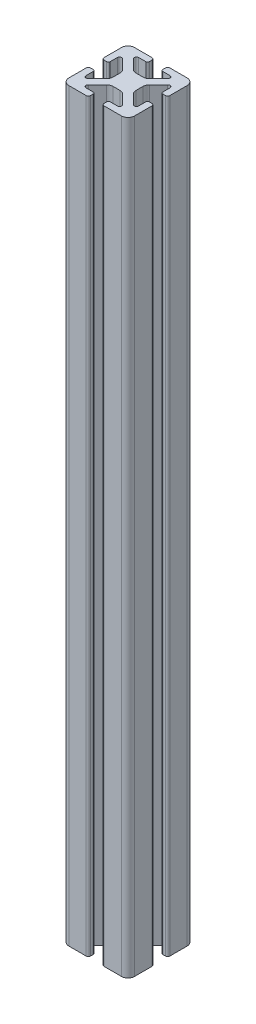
ISO-10303-21;
HEADER;
FILE_DESCRIPTION(('STEP AP214'),'2;1');
FILE_NAME('part.step','',(''),(''),'','','');
FILE_SCHEMA(('AUTOMOTIVE_DESIGN { 1 0 10303 214 1 1 1 1 }'));
ENDSEC;
DATA;
#1=APPLICATION_CONTEXT('core data for automotive mechanical design processes');
#2=APPLICATION_PROTOCOL_DEFINITION('international standard','automotive_design',2000,#1);
#3=PRODUCT_CONTEXT('',#1,'mechanical');
#4=PRODUCT('Part','Part','',(#3));
#5=PRODUCT_RELATED_PRODUCT_CATEGORY('part','',(#4));
#6=PRODUCT_DEFINITION_FORMATION('','',#4);
#7=PRODUCT_DEFINITION_CONTEXT('part definition',#1,'design');
#8=PRODUCT_DEFINITION('design','',#6,#7);
#9=PRODUCT_DEFINITION_SHAPE('','',#8);
#10=(LENGTH_UNIT() NAMED_UNIT(*) SI_UNIT(.MILLI.,.METRE.));
#11=(NAMED_UNIT(*) PLANE_ANGLE_UNIT() SI_UNIT($,.RADIAN.));
#12=(NAMED_UNIT(*) SI_UNIT($,.STERADIAN.) SOLID_ANGLE_UNIT());
#13=UNCERTAINTY_MEASURE_WITH_UNIT(LENGTH_MEASURE(1.E-05),#10,'distance_accuracy_value','');
#14=(GEOMETRIC_REPRESENTATION_CONTEXT(3) GLOBAL_UNCERTAINTY_ASSIGNED_CONTEXT((#13)) GLOBAL_UNIT_ASSIGNED_CONTEXT((#10,
#11,#12)) REPRESENTATION_CONTEXT('',''));
#15=CARTESIAN_POINT('',(0.,0.,0.));
#16=DIRECTION('',(0.,0.,1.));
#17=DIRECTION('',(1.,0.,0.));
#18=AXIS2_PLACEMENT_3D('',#15,#16,#17);
#19=CARTESIAN_POINT('',(0.,-10.,0.));
#20=DIRECTION('',(0.,-1.,0.));
#21=DIRECTION('',(0.,0.,-1.));
#22=AXIS2_PLACEMENT_3D('',#19,#20,#21);
#23=PLANE('',#22);
#24=CARTESIAN_POINT('',(0.,-10.,0.));
#25=DIRECTION('',(0.,1.,0.));
#26=DIRECTION('',(1.,0.,0.));
#27=AXIS2_PLACEMENT_3D('',#24,#25,#26);
#28=CIRCLE('',#27,2.5);
#29=CARTESIAN_POINT('',(2.5,-10.,0.));
#30=VERTEX_POINT('',#29);
#31=CARTESIAN_POINT('',(-2.5,-10.,0.));
#32=VERTEX_POINT('',#31);
#33=EDGE_CURVE('E326',#30,#32,#28,.T.);
#34=ORIENTED_EDGE('',*,*,#33,.T.);
#35=CARTESIAN_POINT('',(0.,-10.,0.));
#36=DIRECTION('',(0.,1.,0.));
#37=DIRECTION('',(1.,0.,0.));
#38=AXIS2_PLACEMENT_3D('',#35,#36,#37);
#39=CIRCLE('',#38,2.5);
#40=EDGE_CURVE('E439',#32,#30,#39,.T.);
#41=ORIENTED_EDGE('',*,*,#40,.T.);
#42=EDGE_LOOP('',(#34,#41));
#43=FACE_BOUND('',#42,.T.);
#44=CARTESIAN_POINT('',(4.1,-10.,-14.));
#45=DIRECTION('',(0.,-1.,0.));
#46=DIRECTION('',(-1.,0.,0.));
#47=AXIS2_PLACEMENT_3D('',#44,#45,#46);
#48=CIRCLE('',#47,1.);
#49=CARTESIAN_POINT('',(3.1,-10.,-14.));
#50=VERTEX_POINT('',#49);
#51=CARTESIAN_POINT('',(4.1,-10.,-15.));
#52=VERTEX_POINT('',#51);
#53=EDGE_CURVE('E305',#50,#52,#48,.T.);
#54=ORIENTED_EDGE('',*,*,#53,.T.);
#55=DIRECTION('',(-1.,0.,0.));
#56=VECTOR('',#55,1.);
#57=CARTESIAN_POINT('',(-12.,-10.,-15.));
#58=LINE('',#57,#56);
#59=CARTESIAN_POINT('',(12.,-10.,-15.));
#60=VERTEX_POINT('',#59);
#61=EDGE_CURVE('E44',#60,#52,#58,.T.);
#62=ORIENTED_EDGE('',*,*,#61,.F.);
#63=CARTESIAN_POINT('',(12.,-10.,-12.));
#64=DIRECTION('',(0.,1.,0.));
#65=DIRECTION('',(0.,0.,-1.));
#66=AXIS2_PLACEMENT_3D('',#63,#64,#65);
#67=CIRCLE('',#66,3.);
#68=CARTESIAN_POINT('',(15.,-10.,-12.));
#69=VERTEX_POINT('',#68);
#70=EDGE_CURVE('E354',#69,#60,#67,.T.);
#71=ORIENTED_EDGE('',*,*,#70,.F.);
#72=DIRECTION('',(0.,0.,-1.));
#73=VECTOR('',#72,1.);
#74=CARTESIAN_POINT('',(15.,-10.,-12.));
#75=LINE('',#74,#73);
#76=CARTESIAN_POINT('',(15.,-10.,-4.1));
#77=VERTEX_POINT('',#76);
#78=EDGE_CURVE('E384',#77,#69,#75,.T.);
#79=ORIENTED_EDGE('',*,*,#78,.F.);
#80=CARTESIAN_POINT('',(14.,-10.,-4.1));
#81=DIRECTION('',(0.,-1.,0.));
#82=DIRECTION('',(1.,0.,0.));
#83=AXIS2_PLACEMENT_3D('',#80,#81,#82);
#84=CIRCLE('',#83,1.);
#85=CARTESIAN_POINT('',(14.,-10.,-3.1));
#86=VERTEX_POINT('',#85);
#87=EDGE_CURVE('E351',#77,#86,#84,.T.);
#88=ORIENTED_EDGE('',*,*,#87,.T.);
#89=DIRECTION('',(-1.,0.,0.));
#90=VECTOR('',#89,1.);
#91=CARTESIAN_POINT('',(6.7,-10.,-3.1));
#92=LINE('',#91,#90);
#93=CARTESIAN_POINT('',(12.8,-10.,-3.1));
#94=VERTEX_POINT('',#93);
#95=EDGE_CURVE('E463',#86,#94,#92,.T.);
#96=ORIENTED_EDGE('',*,*,#95,.T.);
#97=CARTESIAN_POINT('',(12.8,-10.,-3.9));
#98=DIRECTION('',(0.,-1.,0.));
#99=DIRECTION('',(0.,0.,1.));
#100=AXIS2_PLACEMENT_3D('',#97,#98,#99);
#101=CIRCLE('',#100,0.8);
#102=CARTESIAN_POINT('',(12.,-10.,-3.9));
#103=VERTEX_POINT('',#102);
#104=EDGE_CURVE('E548',#94,#103,#101,.T.);
#105=ORIENTED_EDGE('',*,*,#104,.T.);
#106=DIRECTION('',(0.,0.,-1.));
#107=VECTOR('',#106,1.);
#108=CARTESIAN_POINT('',(12.,-10.,-2.7569097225));
#109=LINE('',#108,#107);
#110=CARTESIAN_POINT('',(12.,-10.,-7.12763889));
#111=VERTEX_POINT('',#110);
#112=EDGE_CURVE('E477',#103,#111,#109,.T.);
#113=ORIENTED_EDGE('',*,*,#112,.T.);
#114=CARTESIAN_POINT('',(10.97763889,-10.,-7.12763889));
#115=DIRECTION('',(0.,1.,0.));
#116=DIRECTION('',(-0.707106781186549,0.,-0.707106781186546));
#117=AXIS2_PLACEMENT_3D('',#114,#115,#116);
#118=CIRCLE('',#117,1.0223611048);
#119=CARTESIAN_POINT('',(10.2547204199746,-10.,-7.85055736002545));
#120=VERTEX_POINT('',#119);
#121=EDGE_CURVE('E419',#111,#120,#118,.T.);
#122=ORIENTED_EDGE('',*,*,#121,.T.);
#123=DIRECTION('',(-0.707106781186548,0.,0.707106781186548));
#124=VECTOR('',#123,1.);
#125=CARTESIAN_POINT('',(4.696890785,-10.,-2.292727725));
#126=LINE('',#125,#124);
#127=CARTESIAN_POINT('',(6.12867966,-10.,-3.7245166));
#128=VERTEX_POINT('',#127);
#129=EDGE_CURVE('E418',#120,#128,#126,.T.);
#130=ORIENTED_EDGE('',*,*,#129,.T.);
#131=CARTESIAN_POINT('',(8.25,-10.,-1.60319626));
#132=DIRECTION('',(0.,1.,0.));
#133=DIRECTION('',(-1.,0.,0.));
#134=AXIS2_PLACEMENT_3D('',#131,#132,#133);
#135=CIRCLE('',#134,3.);
#136=CARTESIAN_POINT('',(5.25,-10.,-1.60319626));
#137=VERTEX_POINT('',#136);
#138=EDGE_CURVE('E401',#128,#137,#135,.T.);
#139=ORIENTED_EDGE('',*,*,#138,.T.);
#140=DIRECTION('',(0.,0.,1.));
#141=VECTOR('',#140,1.);
#142=CARTESIAN_POINT('',(5.25,-10.,0.));
#143=LINE('',#142,#141);
#144=CARTESIAN_POINT('',(5.25,-10.,1.60319626));
#145=VERTEX_POINT('',#144);
#146=EDGE_CURVE('E400',#137,#145,#143,.T.);
#147=ORIENTED_EDGE('',*,*,#146,.T.);
#148=CARTESIAN_POINT('',(8.25,-10.,1.60319626));
#149=DIRECTION('',(0.,1.,0.));
#150=DIRECTION('',(-0.707106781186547,0.,0.707106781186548));
#151=AXIS2_PLACEMENT_3D('',#148,#149,#150);
#152=CIRCLE('',#151,2.99999999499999);
#153=CARTESIAN_POINT('',(6.12867965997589,-10.,3.72451660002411));
#154=VERTEX_POINT('',#153);
#155=EDGE_CURVE('E450',#145,#154,#152,.T.);
#156=ORIENTED_EDGE('',*,*,#155,.T.);
#157=DIRECTION('',(0.707106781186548,0.,0.707106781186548));
#158=VECTOR('',#157,1.);
#159=CARTESIAN_POINT('',(4.696890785,-10.,2.292727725));
#160=LINE('',#159,#158);
#161=CARTESIAN_POINT('',(10.25472042,-10.,7.85055736));
#162=VERTEX_POINT('',#161);
#163=EDGE_CURVE('E402',#154,#162,#160,.T.);
#164=ORIENTED_EDGE('',*,*,#163,.T.);
#165=CARTESIAN_POINT('',(10.97763889,-10.,7.12763889));
#166=DIRECTION('',(0.,1.,0.));
#167=DIRECTION('',(1.,0.,0.));
#168=AXIS2_PLACEMENT_3D('',#165,#166,#167);
#169=CIRCLE('',#168,1.02236111);
#170=CARTESIAN_POINT('',(12.,-10.,7.12763889));
#171=VERTEX_POINT('',#170);
#172=EDGE_CURVE('E513',#162,#171,#169,.T.);
#173=ORIENTED_EDGE('',*,*,#172,.T.);
#174=DIRECTION('',(0.,0.,-1.));
#175=VECTOR('',#174,1.);
#176=CARTESIAN_POINT('',(12.,-10.,2.7569097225));
#177=LINE('',#176,#175);
#178=CARTESIAN_POINT('',(12.,-10.,3.9));
#179=VERTEX_POINT('',#178);
#180=EDGE_CURVE('E512',#171,#179,#177,.T.);
#181=ORIENTED_EDGE('',*,*,#180,.T.);
#182=CARTESIAN_POINT('',(12.8,-10.,3.9));
#183=DIRECTION('',(0.,-1.,0.));
#184=DIRECTION('',(-1.,0.,0.));
#185=AXIS2_PLACEMENT_3D('',#182,#183,#184);
#186=CIRCLE('',#185,0.8);
#187=CARTESIAN_POINT('',(12.8,-10.,3.1));
#188=VERTEX_POINT('',#187);
#189=EDGE_CURVE('E654',#179,#188,#186,.T.);
#190=ORIENTED_EDGE('',*,*,#189,.T.);
#191=DIRECTION('',(1.,0.,0.));
#192=VECTOR('',#191,1.);
#193=CARTESIAN_POINT('',(6.7,-10.,3.1));
#194=LINE('',#193,#192);
#195=CARTESIAN_POINT('',(14.,-10.,3.1));
#196=VERTEX_POINT('',#195);
#197=EDGE_CURVE('E421',#188,#196,#194,.T.);
#198=ORIENTED_EDGE('',*,*,#197,.T.);
#199=CARTESIAN_POINT('',(14.,-10.,4.1));
#200=DIRECTION('',(0.,-1.,0.));
#201=DIRECTION('',(0.,0.,-1.));
#202=AXIS2_PLACEMENT_3D('',#199,#200,#201);
#203=CIRCLE('',#202,1.);
#204=CARTESIAN_POINT('',(15.,-10.,4.1));
#205=VERTEX_POINT('',#204);
#206=EDGE_CURVE('E352',#196,#205,#203,.T.);
#207=ORIENTED_EDGE('',*,*,#206,.T.);
#208=DIRECTION('',(0.,0.,-1.));
#209=VECTOR('',#208,1.);
#210=CARTESIAN_POINT('',(15.,-10.,-12.));
#211=LINE('',#210,#209);
#212=CARTESIAN_POINT('',(15.,-10.,12.));
#213=VERTEX_POINT('',#212);
#214=EDGE_CURVE('E552',#213,#205,#211,.T.);
#215=ORIENTED_EDGE('',*,*,#214,.F.);
#216=CARTESIAN_POINT('',(12.,-10.,12.));
#217=DIRECTION('',(0.,1.,0.));
#218=DIRECTION('',(1.,0.,0.));
#219=AXIS2_PLACEMENT_3D('',#216,#217,#218);
#220=CIRCLE('',#219,3.);
#221=CARTESIAN_POINT('',(12.,-10.,15.));
#222=VERTEX_POINT('',#221);
#223=EDGE_CURVE('E502',#222,#213,#220,.T.);
#224=ORIENTED_EDGE('',*,*,#223,.F.);
#225=DIRECTION('',(1.,0.,0.));
#226=VECTOR('',#225,1.);
#227=CARTESIAN_POINT('',(12.,-10.,15.));
#228=LINE('',#227,#226);
#229=CARTESIAN_POINT('',(4.1,-10.,15.));
#230=VERTEX_POINT('',#229);
#231=EDGE_CURVE('E464',#230,#222,#228,.T.);
#232=ORIENTED_EDGE('',*,*,#231,.F.);
#233=CARTESIAN_POINT('',(4.1,-10.,14.));
#234=DIRECTION('',(0.,-1.,0.));
#235=DIRECTION('',(0.,0.,1.));
#236=AXIS2_PLACEMENT_3D('',#233,#234,#235);
#237=CIRCLE('',#236,1.);
#238=CARTESIAN_POINT('',(3.1,-10.,14.));
#239=VERTEX_POINT('',#238);
#240=EDGE_CURVE('E526',#230,#239,#237,.T.);
#241=ORIENTED_EDGE('',*,*,#240,.T.);
#242=DIRECTION('',(0.,0.,-1.));
#243=VECTOR('',#242,1.);
#244=CARTESIAN_POINT('',(3.1,-10.,6.7));
#245=LINE('',#244,#243);
#246=CARTESIAN_POINT('',(3.1,-10.,12.8));
#247=VERTEX_POINT('',#246);
#248=EDGE_CURVE('E38',#239,#247,#245,.T.);
#249=ORIENTED_EDGE('',*,*,#248,.T.);
#250=CARTESIAN_POINT('',(3.9,-10.,12.8));
#251=DIRECTION('',(0.,-1.,0.));
#252=DIRECTION('',(-1.,0.,0.));
#253=AXIS2_PLACEMENT_3D('',#250,#251,#252);
#254=CIRCLE('',#253,0.8);
#255=CARTESIAN_POINT('',(3.9,-10.,12.));
#256=VERTEX_POINT('',#255);
#257=EDGE_CURVE('E473',#247,#256,#254,.T.);
#258=ORIENTED_EDGE('',*,*,#257,.T.);
#259=DIRECTION('',(1.,0.,0.));
#260=VECTOR('',#259,1.);
#261=CARTESIAN_POINT('',(2.7569097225,-10.,12.));
#262=LINE('',#261,#260);
#263=CARTESIAN_POINT('',(7.12763889,-10.,12.));
#264=VERTEX_POINT('',#263);
#265=EDGE_CURVE('E321',#256,#264,#262,.T.);
#266=ORIENTED_EDGE('',*,*,#265,.T.);
#267=CARTESIAN_POINT('',(7.12763889,-10.,10.97763889));
#268=DIRECTION('',(0.,1.,0.));
#269=DIRECTION('',(0.707106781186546,0.,-0.707106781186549));
#270=AXIS2_PLACEMENT_3D('',#267,#268,#269);
#271=CIRCLE('',#270,1.0223611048);
#272=CARTESIAN_POINT('',(7.85055736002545,-10.,10.2547204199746));
#273=VERTEX_POINT('',#272);
#274=EDGE_CURVE('E409',#264,#273,#271,.T.);
#275=ORIENTED_EDGE('',*,*,#274,.T.);
#276=DIRECTION('',(-0.707106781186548,0.,-0.707106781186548));
#277=VECTOR('',#276,1.);
#278=CARTESIAN_POINT('',(2.292727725,-10.,4.696890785));
#279=LINE('',#278,#277);
#280=CARTESIAN_POINT('',(3.7245166,-10.,6.12867966));
#281=VERTEX_POINT('',#280);
#282=EDGE_CURVE('E585',#273,#281,#279,.T.);
#283=ORIENTED_EDGE('',*,*,#282,.T.);
#284=CARTESIAN_POINT('',(1.60319626,-10.,8.25));
#285=DIRECTION('',(0.,1.,0.));
#286=DIRECTION('',(0.,0.,-1.));
#287=AXIS2_PLACEMENT_3D('',#284,#285,#286);
#288=CIRCLE('',#287,3.);
#289=CARTESIAN_POINT('',(1.60319626,-10.,5.25));
#290=VERTEX_POINT('',#289);
#291=EDGE_CURVE('E184',#281,#290,#288,.T.);
#292=ORIENTED_EDGE('',*,*,#291,.T.);
#293=DIRECTION('',(-1.,0.,0.));
#294=VECTOR('',#293,1.);
#295=CARTESIAN_POINT('',(0.,-10.,5.25));
#296=LINE('',#295,#294);
#297=CARTESIAN_POINT('',(-1.60319626,-10.,5.25));
#298=VERTEX_POINT('',#297);
#299=EDGE_CURVE('E177',#290,#298,#296,.T.);
#300=ORIENTED_EDGE('',*,*,#299,.T.);
#301=CARTESIAN_POINT('',(-1.60319626,-10.,8.25));
#302=DIRECTION('',(0.,1.,0.));
#303=DIRECTION('',(-0.707106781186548,0.,-0.707106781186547));
#304=AXIS2_PLACEMENT_3D('',#301,#302,#303);
#305=CIRCLE('',#304,2.99999999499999);
#306=CARTESIAN_POINT('',(-3.72451660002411,-10.,6.12867965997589));
#307=VERTEX_POINT('',#306);
#308=EDGE_CURVE('E437',#298,#307,#305,.T.);
#309=ORIENTED_EDGE('',*,*,#308,.T.);
#310=DIRECTION('',(-0.707106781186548,0.,0.707106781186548));
#311=VECTOR('',#310,1.);
#312=CARTESIAN_POINT('',(-2.292727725,-10.,4.696890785));
#313=LINE('',#312,#311);
#314=CARTESIAN_POINT('',(-7.85055736,-10.,10.25472042));
#315=VERTEX_POINT('',#314);
#316=EDGE_CURVE('E374',#307,#315,#313,.T.);
#317=ORIENTED_EDGE('',*,*,#316,.T.);
#318=CARTESIAN_POINT('',(-7.12763889,-10.,10.97763889));
#319=DIRECTION('',(0.,1.,0.));
#320=DIRECTION('',(0.,0.,1.));
#321=AXIS2_PLACEMENT_3D('',#318,#319,#320);
#322=CIRCLE('',#321,1.02236111);
#323=CARTESIAN_POINT('',(-7.12763889,-10.,12.));
#324=VERTEX_POINT('',#323);
#325=EDGE_CURVE('E446',#315,#324,#322,.T.);
#326=ORIENTED_EDGE('',*,*,#325,.T.);
#327=DIRECTION('',(1.,0.,0.));
#328=VECTOR('',#327,1.);
#329=CARTESIAN_POINT('',(-2.7569097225,-10.,12.));
#330=LINE('',#329,#328);
#331=CARTESIAN_POINT('',(-3.9,-10.,12.));
#332=VERTEX_POINT('',#331);
#333=EDGE_CURVE('E459',#324,#332,#330,.T.);
#334=ORIENTED_EDGE('',*,*,#333,.T.);
#335=CARTESIAN_POINT('',(-3.9,-10.,12.8));
#336=DIRECTION('',(0.,-1.,0.));
#337=DIRECTION('',(0.,0.,-1.));
#338=AXIS2_PLACEMENT_3D('',#335,#336,#337);
#339=CIRCLE('',#338,0.8);
#340=CARTESIAN_POINT('',(-3.1,-10.,12.8));
#341=VERTEX_POINT('',#340);
#342=EDGE_CURVE('E359',#332,#341,#339,.T.);
#343=ORIENTED_EDGE('',*,*,#342,.T.);
#344=DIRECTION('',(0.,0.,1.));
#345=VECTOR('',#344,1.);
#346=CARTESIAN_POINT('',(-3.1,-10.,6.7));
#347=LINE('',#346,#345);
#348=CARTESIAN_POINT('',(-3.1,-10.,14.));
#349=VERTEX_POINT('',#348);
#350=EDGE_CURVE('E358',#341,#349,#347,.T.);
#351=ORIENTED_EDGE('',*,*,#350,.T.);
#352=CARTESIAN_POINT('',(-4.1,-10.,14.));
#353=DIRECTION('',(0.,-1.,0.));
#354=DIRECTION('',(1.,0.,0.));
#355=AXIS2_PLACEMENT_3D('',#352,#353,#354);
#356=CIRCLE('',#355,1.);
#357=CARTESIAN_POINT('',(-4.1,-10.,15.));
#358=VERTEX_POINT('',#357);
#359=EDGE_CURVE('E451',#349,#358,#356,.T.);
#360=ORIENTED_EDGE('',*,*,#359,.T.);
#361=DIRECTION('',(1.,0.,0.));
#362=VECTOR('',#361,1.);
#363=CARTESIAN_POINT('',(12.,-10.,15.));
#364=LINE('',#363,#362);
#365=CARTESIAN_POINT('',(-12.,-10.,15.));
#366=VERTEX_POINT('',#365);
#367=EDGE_CURVE('E499',#366,#358,#364,.T.);
#368=ORIENTED_EDGE('',*,*,#367,.F.);
#369=CARTESIAN_POINT('',(-12.,-10.,12.));
#370=DIRECTION('',(0.,1.,0.));
#371=DIRECTION('',(0.,0.,1.));
#372=AXIS2_PLACEMENT_3D('',#369,#370,#371);
#373=CIRCLE('',#372,3.);
#374=CARTESIAN_POINT('',(-15.,-10.,12.));
#375=VERTEX_POINT('',#374);
#376=EDGE_CURVE('E604',#375,#366,#373,.T.);
#377=ORIENTED_EDGE('',*,*,#376,.F.);
#378=DIRECTION('',(0.,0.,1.));
#379=VECTOR('',#378,1.);
#380=CARTESIAN_POINT('',(-15.,-10.,12.));
#381=LINE('',#380,#379);
#382=CARTESIAN_POINT('',(-15.,-10.,4.1));
#383=VERTEX_POINT('',#382);
#384=EDGE_CURVE('E340',#383,#375,#381,.T.);
#385=ORIENTED_EDGE('',*,*,#384,.F.);
#386=CARTESIAN_POINT('',(-14.,-10.,4.1));
#387=DIRECTION('',(0.,-1.,0.));
#388=DIRECTION('',(-1.,0.,0.));
#389=AXIS2_PLACEMENT_3D('',#386,#387,#388);
#390=CIRCLE('',#389,1.);
#391=CARTESIAN_POINT('',(-14.,-10.,3.1));
#392=VERTEX_POINT('',#391);
#393=EDGE_CURVE('E389',#383,#392,#390,.T.);
#394=ORIENTED_EDGE('',*,*,#393,.T.);
#395=DIRECTION('',(1.,0.,0.));
#396=VECTOR('',#395,1.);
#397=CARTESIAN_POINT('',(-6.7,-10.,3.1));
#398=LINE('',#397,#396);
#399=CARTESIAN_POINT('',(-12.8,-10.,3.1));
#400=VERTEX_POINT('',#399);
#401=EDGE_CURVE('E503',#392,#400,#398,.T.);
#402=ORIENTED_EDGE('',*,*,#401,.T.);
#403=CARTESIAN_POINT('',(-12.8,-10.,3.9));
#404=DIRECTION('',(0.,-1.,0.));
#405=DIRECTION('',(0.,0.,-1.));
#406=AXIS2_PLACEMENT_3D('',#403,#404,#405);
#407=CIRCLE('',#406,0.8);
#408=CARTESIAN_POINT('',(-12.,-10.,3.9));
#409=VERTEX_POINT('',#408);
#410=EDGE_CURVE('E281',#400,#409,#407,.T.);
#411=ORIENTED_EDGE('',*,*,#410,.T.);
#412=DIRECTION('',(0.,0.,1.));
#413=VECTOR('',#412,1.);
#414=CARTESIAN_POINT('',(-12.,-10.,2.7569097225));
#415=LINE('',#414,#413);
#416=CARTESIAN_POINT('',(-12.,-10.,7.12763889));
#417=VERTEX_POINT('',#416);
#418=EDGE_CURVE('E274',#409,#417,#415,.T.);
#419=ORIENTED_EDGE('',*,*,#418,.T.);
#420=CARTESIAN_POINT('',(-10.97763889,-10.,7.12763889));
#421=DIRECTION('',(0.,1.,0.));
#422=DIRECTION('',(0.707106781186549,0.,0.707106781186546));
#423=AXIS2_PLACEMENT_3D('',#420,#421,#422);
#424=CIRCLE('',#423,1.0223611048);
#425=CARTESIAN_POINT('',(-10.2547204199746,-10.,7.85055736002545));
#426=VERTEX_POINT('',#425);
#427=EDGE_CURVE('E577',#417,#426,#424,.T.);
#428=ORIENTED_EDGE('',*,*,#427,.T.);
#429=DIRECTION('',(0.707106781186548,0.,-0.707106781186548));
#430=VECTOR('',#429,1.);
#431=CARTESIAN_POINT('',(-4.696890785,-10.,2.292727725));
#432=LINE('',#431,#430);
#433=CARTESIAN_POINT('',(-6.12867966,-10.,3.7245166));
#434=VERTEX_POINT('',#433);
#435=EDGE_CURVE('E383',#426,#434,#432,.T.);
#436=ORIENTED_EDGE('',*,*,#435,.T.);
#437=CARTESIAN_POINT('',(-8.25,-10.,1.60319626));
#438=DIRECTION('',(0.,1.,0.));
#439=DIRECTION('',(1.,0.,0.));
#440=AXIS2_PLACEMENT_3D('',#437,#438,#439);
#441=CIRCLE('',#440,3.);
#442=CARTESIAN_POINT('',(-5.25,-10.,1.60319626));
#443=VERTEX_POINT('',#442);
#444=EDGE_CURVE('E382',#434,#443,#441,.T.);
#445=ORIENTED_EDGE('',*,*,#444,.T.);
#446=DIRECTION('',(0.,0.,-1.));
#447=VECTOR('',#446,1.);
#448=CARTESIAN_POINT('',(-5.25,-10.,0.));
#449=LINE('',#448,#447);
#450=CARTESIAN_POINT('',(-5.25,-10.,-1.60319626));
#451=VERTEX_POINT('',#450);
#452=EDGE_CURVE('E332',#443,#451,#449,.T.);
#453=ORIENTED_EDGE('',*,*,#452,.T.);
#454=CARTESIAN_POINT('',(-8.25,-10.,-1.60319626));
#455=DIRECTION('',(0.,1.,0.));
#456=DIRECTION('',(0.707106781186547,0.,-0.707106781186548));
#457=AXIS2_PLACEMENT_3D('',#454,#455,#456);
#458=CIRCLE('',#457,2.99999999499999);
#459=CARTESIAN_POINT('',(-6.12867965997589,-10.,-3.72451660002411));
#460=VERTEX_POINT('',#459);
#461=EDGE_CURVE('E593',#451,#460,#458,.T.);
#462=ORIENTED_EDGE('',*,*,#461,.T.);
#463=DIRECTION('',(-0.707106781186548,0.,-0.707106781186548));
#464=VECTOR('',#463,1.);
#465=CARTESIAN_POINT('',(-4.696890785,-10.,-2.292727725));
#466=LINE('',#465,#464);
#467=CARTESIAN_POINT('',(-10.25472042,-10.,-7.85055736));
#468=VERTEX_POINT('',#467);
#469=EDGE_CURVE('E628',#460,#468,#466,.T.);
#470=ORIENTED_EDGE('',*,*,#469,.T.);
#471=CARTESIAN_POINT('',(-10.97763889,-10.,-7.12763889));
#472=DIRECTION('',(0.,1.,0.));
#473=DIRECTION('',(-1.,0.,0.));
#474=AXIS2_PLACEMENT_3D('',#471,#472,#473);
#475=CIRCLE('',#474,1.02236111);
#476=CARTESIAN_POINT('',(-12.,-10.,-7.12763889));
#477=VERTEX_POINT('',#476);
#478=EDGE_CURVE('E518',#468,#477,#475,.T.);
#479=ORIENTED_EDGE('',*,*,#478,.T.);
#480=DIRECTION('',(0.,0.,1.));
#481=VECTOR('',#480,1.);
#482=CARTESIAN_POINT('',(-12.,-10.,-2.7569097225));
#483=LINE('',#482,#481);
#484=CARTESIAN_POINT('',(-12.,-10.,-3.9));
#485=VERTEX_POINT('',#484);
#486=EDGE_CURVE('E572',#477,#485,#483,.T.);
#487=ORIENTED_EDGE('',*,*,#486,.T.);
#488=CARTESIAN_POINT('',(-12.8,-10.,-3.9));
#489=DIRECTION('',(0.,-1.,0.));
#490=DIRECTION('',(1.,0.,0.));
#491=AXIS2_PLACEMENT_3D('',#488,#489,#490);
#492=CIRCLE('',#491,0.8);
#493=CARTESIAN_POINT('',(-12.8,-10.,-3.1));
#494=VERTEX_POINT('',#493);
#495=EDGE_CURVE('E541',#485,#494,#492,.T.);
#496=ORIENTED_EDGE('',*,*,#495,.T.);
#497=DIRECTION('',(-1.,0.,0.));
#498=VECTOR('',#497,1.);
#499=CARTESIAN_POINT('',(-6.7,-10.,-3.1));
#500=LINE('',#499,#498);
#501=CARTESIAN_POINT('',(-14.,-10.,-3.1));
#502=VERTEX_POINT('',#501);
#503=EDGE_CURVE('E560',#494,#502,#500,.T.);
#504=ORIENTED_EDGE('',*,*,#503,.T.);
#505=CARTESIAN_POINT('',(-14.,-10.,-4.1));
#506=DIRECTION('',(0.,-1.,0.));
#507=DIRECTION('',(0.,0.,1.));
#508=AXIS2_PLACEMENT_3D('',#505,#506,#507);
#509=CIRCLE('',#508,1.);
#510=CARTESIAN_POINT('',(-15.,-10.,-4.1));
#511=VERTEX_POINT('',#510);
#512=EDGE_CURVE('E341',#502,#511,#509,.T.);
#513=ORIENTED_EDGE('',*,*,#512,.T.);
#514=DIRECTION('',(0.,0.,1.));
#515=VECTOR('',#514,1.);
#516=CARTESIAN_POINT('',(-15.,-10.,12.));
#517=LINE('',#516,#515);
#518=CARTESIAN_POINT('',(-15.,-10.,-12.));
#519=VERTEX_POINT('',#518);
#520=EDGE_CURVE('E587',#519,#511,#517,.T.);
#521=ORIENTED_EDGE('',*,*,#520,.F.);
#522=CARTESIAN_POINT('',(-12.,-10.,-12.));
#523=DIRECTION('',(0.,1.,0.));
#524=DIRECTION('',(-1.,0.,0.));
#525=AXIS2_PLACEMENT_3D('',#522,#523,#524);
#526=CIRCLE('',#525,3.);
#527=CARTESIAN_POINT('',(-12.,-10.,-15.));
#528=VERTEX_POINT('',#527);
#529=EDGE_CURVE('E11',#528,#519,#526,.T.);
#530=ORIENTED_EDGE('',*,*,#529,.F.);
#531=DIRECTION('',(-1.,0.,0.));
#532=VECTOR('',#531,1.);
#533=CARTESIAN_POINT('',(-12.,-10.,-15.));
#534=LINE('',#533,#532);
#535=CARTESIAN_POINT('',(-4.1,-10.,-15.));
#536=VERTEX_POINT('',#535);
#537=EDGE_CURVE('E365',#536,#528,#534,.T.);
#538=ORIENTED_EDGE('',*,*,#537,.F.);
#539=CARTESIAN_POINT('',(-4.1,-10.,-14.));
#540=DIRECTION('',(0.,-1.,0.));
#541=DIRECTION('',(0.,0.,-1.));
#542=AXIS2_PLACEMENT_3D('',#539,#540,#541);
#543=CIRCLE('',#542,1.);
#544=CARTESIAN_POINT('',(-3.1,-10.,-14.));
#545=VERTEX_POINT('',#544);
#546=EDGE_CURVE('E309',#536,#545,#543,.T.);
#547=ORIENTED_EDGE('',*,*,#546,.T.);
#548=DIRECTION('',(0.,0.,1.));
#549=VECTOR('',#548,1.);
#550=CARTESIAN_POINT('',(-3.1,-10.,-6.7));
#551=LINE('',#550,#549);
#552=CARTESIAN_POINT('',(-3.1,-10.,-12.8));
#553=VERTEX_POINT('',#552);
#554=EDGE_CURVE('E328',#545,#553,#551,.T.);
#555=ORIENTED_EDGE('',*,*,#554,.T.);
#556=CARTESIAN_POINT('',(-3.9,-10.,-12.8));
#557=DIRECTION('',(0.,-1.,0.));
#558=DIRECTION('',(1.,0.,0.));
#559=AXIS2_PLACEMENT_3D('',#556,#557,#558);
#560=CIRCLE('',#559,0.8);
#561=CARTESIAN_POINT('',(-3.9,-10.,-12.));
#562=VERTEX_POINT('',#561);
#563=EDGE_CURVE('E395',#553,#562,#560,.T.);
#564=ORIENTED_EDGE('',*,*,#563,.T.);
#565=DIRECTION('',(-1.,0.,0.));
#566=VECTOR('',#565,1.);
#567=CARTESIAN_POINT('',(-2.7569097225,-10.,-12.));
#568=LINE('',#567,#566);
#569=CARTESIAN_POINT('',(-7.12763889,-10.,-12.));
#570=VERTEX_POINT('',#569);
#571=EDGE_CURVE('E498',#562,#570,#568,.T.);
#572=ORIENTED_EDGE('',*,*,#571,.T.);
#573=CARTESIAN_POINT('',(-7.12763889,-10.,-10.97763889));
#574=DIRECTION('',(0.,1.,0.));
#575=DIRECTION('',(-0.707106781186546,0.,0.707106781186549));
#576=AXIS2_PLACEMENT_3D('',#573,#574,#575);
#577=CIRCLE('',#576,1.0223611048);
#578=CARTESIAN_POINT('',(-7.85055736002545,-10.,-10.2547204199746));
#579=VERTEX_POINT('',#578);
#580=EDGE_CURVE('E429',#570,#579,#577,.T.);
#581=ORIENTED_EDGE('',*,*,#580,.T.);
#582=DIRECTION('',(0.707106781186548,0.,0.707106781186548));
#583=VECTOR('',#582,1.);
#584=CARTESIAN_POINT('',(-2.292727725,-10.,-4.696890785));
#585=LINE('',#584,#583);
#586=CARTESIAN_POINT('',(-3.7245166,-10.,-6.12867966));
#587=VERTEX_POINT('',#586);
#588=EDGE_CURVE('E488',#579,#587,#585,.T.);
#589=ORIENTED_EDGE('',*,*,#588,.T.);
#590=CARTESIAN_POINT('',(-1.60319626,-10.,-8.25));
#591=DIRECTION('',(0.,1.,0.));
#592=DIRECTION('',(0.,0.,1.));
#593=AXIS2_PLACEMENT_3D('',#590,#591,#592);
#594=CIRCLE('',#593,3.);
#595=CARTESIAN_POINT('',(-1.60319626,-10.,-5.25));
#596=VERTEX_POINT('',#595);
#597=EDGE_CURVE('E369',#587,#596,#594,.T.);
#598=ORIENTED_EDGE('',*,*,#597,.T.);
#599=DIRECTION('',(1.,0.,0.));
#600=VECTOR('',#599,1.);
#601=CARTESIAN_POINT('',(0.,-10.,-5.25));
#602=LINE('',#601,#600);
#603=CARTESIAN_POINT('',(1.60319626,-10.,-5.25));
#604=VERTEX_POINT('',#603);
#605=EDGE_CURVE('E623',#596,#604,#602,.T.);
#606=ORIENTED_EDGE('',*,*,#605,.T.);
#607=CARTESIAN_POINT('',(1.60319626,-10.,-8.25));
#608=DIRECTION('',(0.,1.,0.));
#609=DIRECTION('',(0.707106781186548,0.,0.707106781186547));
#610=AXIS2_PLACEMENT_3D('',#607,#608,#609);
#611=CIRCLE('',#610,2.99999999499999);
#612=CARTESIAN_POINT('',(3.72451660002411,-10.,-6.12867965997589));
#613=VERTEX_POINT('',#612);
#614=EDGE_CURVE('E622',#604,#613,#611,.T.);
#615=ORIENTED_EDGE('',*,*,#614,.T.);
#616=DIRECTION('',(0.707106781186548,0.,-0.707106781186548));
#617=VECTOR('',#616,1.);
#618=CARTESIAN_POINT('',(2.292727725,-10.,-4.696890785));
#619=LINE('',#618,#617);
#620=CARTESIAN_POINT('',(7.85055736,-10.,-10.25472042));
#621=VERTEX_POINT('',#620);
#622=EDGE_CURVE('E532',#613,#621,#619,.T.);
#623=ORIENTED_EDGE('',*,*,#622,.T.);
#624=CARTESIAN_POINT('',(7.12763889,-10.,-10.97763889));
#625=DIRECTION('',(0.,1.,0.));
#626=DIRECTION('',(0.,0.,-1.));
#627=AXIS2_PLACEMENT_3D('',#624,#625,#626);
#628=CIRCLE('',#627,1.02236111);
#629=CARTESIAN_POINT('',(7.12763889,-10.,-12.));
#630=VERTEX_POINT('',#629);
#631=EDGE_CURVE('E485',#621,#630,#628,.T.);
#632=ORIENTED_EDGE('',*,*,#631,.T.);
#633=DIRECTION('',(-1.,0.,0.));
#634=VECTOR('',#633,1.);
#635=CARTESIAN_POINT('',(2.7569097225,-10.,-12.));
#636=LINE('',#635,#634);
#637=CARTESIAN_POINT('',(3.9,-10.,-12.));
#638=VERTEX_POINT('',#637);
#639=EDGE_CURVE('E364',#630,#638,#636,.T.);
#640=ORIENTED_EDGE('',*,*,#639,.T.);
#641=CARTESIAN_POINT('',(3.9,-10.,-12.8));
#642=DIRECTION('',(0.,-1.,0.));
#643=DIRECTION('',(0.,0.,1.));
#644=AXIS2_PLACEMENT_3D('',#641,#642,#643);
#645=CIRCLE('',#644,0.8);
#646=CARTESIAN_POINT('',(3.1,-10.,-12.8));
#647=VERTEX_POINT('',#646);
#648=EDGE_CURVE('E363',#638,#647,#645,.T.);
#649=ORIENTED_EDGE('',*,*,#648,.T.);
#650=DIRECTION('',(0.,0.,-1.));
#651=VECTOR('',#650,1.);
#652=CARTESIAN_POINT('',(3.1,-10.,-6.7));
#653=LINE('',#652,#651);
#654=EDGE_CURVE('E313',#647,#50,#653,.T.);
#655=ORIENTED_EDGE('',*,*,#654,.T.);
#656=EDGE_LOOP('',(#54,#62,#71,#79,#88,#96,#105,#113,#122,#130,#139,#147,#156,#164,#173,#181,
#190,#198,#207,#215,#224,#232,#241,#249,#258,#266,#275,#283,#292,#300,#309,#317,#326,#334,#343,
#351,#360,#368,#377,#385,#394,#402,#411,#419,#428,#436,#445,#453,#462,#470,#479,#487,#496,#504,
#513,#521,#530,#538,#547,#555,#564,#572,#581,#589,#598,#606,#615,#623,#632,#640,#649,#655));
#657=FACE_BOUND('',#656,.T.);
#658=ADVANCED_FACE('F34',(#43,#657),#23,.T.);
#659=CARTESIAN_POINT('',(-12.,10.,-12.));
#660=DIRECTION('',(0.,-1.,0.));
#661=DIRECTION('',(-1.,0.,0.));
#662=AXIS2_PLACEMENT_3D('',#659,#660,#661);
#663=CYLINDRICAL_SURFACE('',#662,3.);
#664=ORIENTED_EDGE('',*,*,#529,.T.);
#665=DIRECTION('',(0.,-1.,0.));
#666=VECTOR('',#665,1.);
#667=CARTESIAN_POINT('',(-15.,10.,-12.));
#668=LINE('',#667,#666);
#669=CARTESIAN_POINT('',(-15.,330.,-12.));
#670=VERTEX_POINT('',#669);
#671=EDGE_CURVE('E565',#670,#519,#668,.T.);
#672=ORIENTED_EDGE('',*,*,#671,.F.);
#673=CARTESIAN_POINT('',(-12.,330.,-12.));
#674=DIRECTION('',(0.,1.,0.));
#675=DIRECTION('',(0.,0.,1.));
#676=AXIS2_PLACEMENT_3D('',#673,#674,#675);
#677=CIRCLE('',#676,3.);
#678=CARTESIAN_POINT('',(-12.,330.,-15.));
#679=VERTEX_POINT('',#678);
#680=EDGE_CURVE('E1423',#679,#670,#677,.T.);
#681=ORIENTED_EDGE('',*,*,#680,.F.);
#682=DIRECTION('',(0.,-1.,0.));
#683=VECTOR('',#682,1.);
#684=CARTESIAN_POINT('',(-12.,10.,-15.));
#685=LINE('',#684,#683);
#686=EDGE_CURVE('E368',#679,#528,#685,.T.);
#687=ORIENTED_EDGE('',*,*,#686,.T.);
#688=EDGE_LOOP('',(#664,#672,#681,#687));
#689=FACE_BOUND('',#688,.T.);
#690=ADVANCED_FACE('F945',(#689),#663,.T.);
#691=CARTESIAN_POINT('',(0.,10.,-15.));
#692=DIRECTION('',(0.,0.,-1.));
#693=DIRECTION('',(0.,-1.,0.));
#694=AXIS2_PLACEMENT_3D('',#691,#692,#693);
#695=PLANE('',#694);
#696=DIRECTION('',(0.,1.,0.));
#697=VECTOR('',#696,1.);
#698=CARTESIAN_POINT('',(4.1,0.,-15.));
#699=LINE('',#698,#697);
#700=CARTESIAN_POINT('',(4.1,330.,-15.));
#701=VERTEX_POINT('',#700);
#702=EDGE_CURVE('E296',#52,#701,#699,.T.);
#703=ORIENTED_EDGE('',*,*,#702,.T.);
#704=DIRECTION('',(-1.,0.,0.));
#705=VECTOR('',#704,1.);
#706=CARTESIAN_POINT('',(12.,330.,-15.));
#707=LINE('',#706,#705);
#708=CARTESIAN_POINT('',(12.,330.,-15.));
#709=VERTEX_POINT('',#708);
#710=EDGE_CURVE('E540',#709,#701,#707,.T.);
#711=ORIENTED_EDGE('',*,*,#710,.F.);
#712=DIRECTION('',(0.,-1.,0.));
#713=VECTOR('',#712,1.);
#714=CARTESIAN_POINT('',(12.,10.,-15.));
#715=LINE('',#714,#713);
#716=EDGE_CURVE('E299',#709,#60,#715,.T.);
#717=ORIENTED_EDGE('',*,*,#716,.T.);
#718=ORIENTED_EDGE('',*,*,#61,.T.);
#719=EDGE_LOOP('',(#703,#711,#717,#718));
#720=FACE_BOUND('',#719,.T.);
#721=ADVANCED_FACE('F293',(#720),#695,.T.);
#722=CARTESIAN_POINT('',(12.,10.,-12.));
#723=DIRECTION('',(0.,-1.,0.));
#724=DIRECTION('',(0.,0.,-1.));
#725=AXIS2_PLACEMENT_3D('',#722,#723,#724);
#726=CYLINDRICAL_SURFACE('',#725,3.);
#727=ORIENTED_EDGE('',*,*,#70,.T.);
#728=ORIENTED_EDGE('',*,*,#716,.F.);
#729=CARTESIAN_POINT('',(12.,330.,-12.));
#730=DIRECTION('',(0.,1.,0.));
#731=DIRECTION('',(0.,0.,1.));
#732=AXIS2_PLACEMENT_3D('',#729,#730,#731);
#733=CIRCLE('',#732,3.);
#734=CARTESIAN_POINT('',(15.,330.,-12.));
#735=VERTEX_POINT('',#734);
#736=EDGE_CURVE('E736',#735,#709,#733,.T.);
#737=ORIENTED_EDGE('',*,*,#736,.F.);
#738=DIRECTION('',(0.,-1.,0.));
#739=VECTOR('',#738,1.);
#740=CARTESIAN_POINT('',(15.,10.,-12.));
#741=LINE('',#740,#739);
#742=EDGE_CURVE('E387',#735,#69,#741,.T.);
#743=ORIENTED_EDGE('',*,*,#742,.T.);
#744=EDGE_LOOP('',(#727,#728,#737,#743));
#745=FACE_BOUND('',#744,.T.);
#746=ADVANCED_FACE('F955',(#745),#726,.T.);
#747=CARTESIAN_POINT('',(15.,10.,0.));
#748=DIRECTION('',(1.,0.,0.));
#749=DIRECTION('',(0.,1.,0.));
#750=AXIS2_PLACEMENT_3D('',#747,#748,#749);
#751=PLANE('',#750);
#752=DIRECTION('',(0.,1.,0.));
#753=VECTOR('',#752,1.);
#754=CARTESIAN_POINT('',(15.,0.,4.1));
#755=LINE('',#754,#753);
#756=CARTESIAN_POINT('',(15.,330.,4.1));
#757=VERTEX_POINT('',#756);
#758=EDGE_CURVE('E348',#205,#757,#755,.T.);
#759=ORIENTED_EDGE('',*,*,#758,.T.);
#760=DIRECTION('',(0.,0.,-1.));
#761=VECTOR('',#760,1.);
#762=CARTESIAN_POINT('',(15.,330.,12.));
#763=LINE('',#762,#761);
#764=CARTESIAN_POINT('',(15.,330.,12.));
#765=VERTEX_POINT('',#764);
#766=EDGE_CURVE('E865',#765,#757,#763,.T.);
#767=ORIENTED_EDGE('',*,*,#766,.F.);
#768=DIRECTION('',(0.,-1.,0.));
#769=VECTOR('',#768,1.);
#770=CARTESIAN_POINT('',(15.,10.,12.));
#771=LINE('',#770,#769);
#772=EDGE_CURVE('E639',#765,#213,#771,.T.);
#773=ORIENTED_EDGE('',*,*,#772,.T.);
#774=ORIENTED_EDGE('',*,*,#214,.T.);
#775=EDGE_LOOP('',(#759,#767,#773,#774));
#776=FACE_BOUND('',#775,.T.);
#777=ADVANCED_FACE('F1029',(#776),#751,.T.);
#778=CARTESIAN_POINT('',(12.,10.,12.));
#779=DIRECTION('',(0.,-1.,0.));
#780=DIRECTION('',(1.,0.,0.));
#781=AXIS2_PLACEMENT_3D('',#778,#779,#780);
#782=CYLINDRICAL_SURFACE('',#781,3.);
#783=ORIENTED_EDGE('',*,*,#223,.T.);
#784=ORIENTED_EDGE('',*,*,#772,.F.);
#785=CARTESIAN_POINT('',(12.,330.,12.));
#786=DIRECTION('',(0.,1.,0.));
#787=DIRECTION('',(0.,0.,1.));
#788=AXIS2_PLACEMENT_3D('',#785,#786,#787);
#789=CIRCLE('',#788,3.);
#790=CARTESIAN_POINT('',(12.,330.,15.));
#791=VERTEX_POINT('',#790);
#792=EDGE_CURVE('E862',#791,#765,#789,.T.);
#793=ORIENTED_EDGE('',*,*,#792,.F.);
#794=DIRECTION('',(0.,-1.,0.));
#795=VECTOR('',#794,1.);
#796=CARTESIAN_POINT('',(12.,10.,15.));
#797=LINE('',#796,#795);
#798=EDGE_CURVE('E460',#791,#222,#797,.T.);
#799=ORIENTED_EDGE('',*,*,#798,.T.);
#800=EDGE_LOOP('',(#783,#784,#793,#799));
#801=FACE_BOUND('',#800,.T.);
#802=ADVANCED_FACE('F1026',(#801),#782,.T.);
#803=CARTESIAN_POINT('',(0.,10.,15.));
#804=DIRECTION('',(0.,0.,1.));
#805=DIRECTION('',(1.,0.,0.));
#806=AXIS2_PLACEMENT_3D('',#803,#804,#805);
#807=PLANE('',#806);
#808=DIRECTION('',(0.,1.,0.));
#809=VECTOR('',#808,1.);
#810=CARTESIAN_POINT('',(-4.1,0.,15.));
#811=LINE('',#810,#809);
#812=CARTESIAN_POINT('',(-4.1,330.,15.));
#813=VERTEX_POINT('',#812);
#814=EDGE_CURVE('E454',#358,#813,#811,.T.);
#815=ORIENTED_EDGE('',*,*,#814,.T.);
#816=DIRECTION('',(1.,0.,0.));
#817=VECTOR('',#816,1.);
#818=CARTESIAN_POINT('',(-12.,330.,15.));
#819=LINE('',#818,#817);
#820=CARTESIAN_POINT('',(-12.,330.,15.));
#821=VERTEX_POINT('',#820);
#822=EDGE_CURVE('E806',#821,#813,#819,.T.);
#823=ORIENTED_EDGE('',*,*,#822,.F.);
#824=DIRECTION('',(0.,-1.,0.));
#825=VECTOR('',#824,1.);
#826=CARTESIAN_POINT('',(-12.,10.,15.));
#827=LINE('',#826,#825);
#828=EDGE_CURVE('E319',#821,#366,#827,.T.);
#829=ORIENTED_EDGE('',*,*,#828,.T.);
#830=ORIENTED_EDGE('',*,*,#367,.T.);
#831=EDGE_LOOP('',(#815,#823,#829,#830));
#832=FACE_BOUND('',#831,.T.);
#833=ADVANCED_FACE('F974',(#832),#807,.T.);
#834=CARTESIAN_POINT('',(-12.,10.,12.));
#835=DIRECTION('',(0.,-1.,0.));
#836=DIRECTION('',(0.,0.,1.));
#837=AXIS2_PLACEMENT_3D('',#834,#835,#836);
#838=CYLINDRICAL_SURFACE('',#837,3.);
#839=ORIENTED_EDGE('',*,*,#376,.T.);
#840=ORIENTED_EDGE('',*,*,#828,.F.);
#841=CARTESIAN_POINT('',(-12.,330.,12.));
#842=DIRECTION('',(0.,1.,0.));
#843=DIRECTION('',(0.,0.,1.));
#844=AXIS2_PLACEMENT_3D('',#841,#842,#843);
#845=CIRCLE('',#844,3.);
#846=CARTESIAN_POINT('',(-15.,330.,12.));
#847=VERTEX_POINT('',#846);
#848=EDGE_CURVE('E800',#847,#821,#845,.T.);
#849=ORIENTED_EDGE('',*,*,#848,.F.);
#850=DIRECTION('',(0.,-1.,0.));
#851=VECTOR('',#850,1.);
#852=CARTESIAN_POINT('',(-15.,10.,12.));
#853=LINE('',#852,#851);
#854=EDGE_CURVE('E337',#847,#375,#853,.T.);
#855=ORIENTED_EDGE('',*,*,#854,.T.);
#856=EDGE_LOOP('',(#839,#840,#849,#855));
#857=FACE_BOUND('',#856,.T.);
#858=ADVANCED_FACE('F798',(#857),#838,.T.);
#859=CARTESIAN_POINT('',(-15.,10.,0.));
#860=DIRECTION('',(-1.,0.,0.));
#861=DIRECTION('',(0.,0.,1.));
#862=AXIS2_PLACEMENT_3D('',#859,#860,#861);
#863=PLANE('',#862);
#864=DIRECTION('',(0.,1.,0.));
#865=VECTOR('',#864,1.);
#866=CARTESIAN_POINT('',(-15.,0.,-4.1));
#867=LINE('',#866,#865);
#868=CARTESIAN_POINT('',(-15.,330.,-4.1));
#869=VERTEX_POINT('',#868);
#870=EDGE_CURVE('E344',#511,#869,#867,.T.);
#871=ORIENTED_EDGE('',*,*,#870,.T.);
#872=DIRECTION('',(0.,0.,1.));
#873=VECTOR('',#872,1.);
#874=CARTESIAN_POINT('',(-15.,330.,-12.));
#875=LINE('',#874,#873);
#876=EDGE_CURVE('E1426',#670,#869,#875,.T.);
#877=ORIENTED_EDGE('',*,*,#876,.F.);
#878=ORIENTED_EDGE('',*,*,#671,.T.);
#879=ORIENTED_EDGE('',*,*,#520,.T.);
#880=EDGE_LOOP('',(#871,#877,#878,#879));
#881=FACE_BOUND('',#880,.T.);
#882=ADVANCED_FACE('F973',(#881),#863,.T.);
#883=CARTESIAN_POINT('',(15.,10.,0.));
#884=DIRECTION('',(1.,0.,0.));
#885=DIRECTION('',(0.,1.,0.));
#886=AXIS2_PLACEMENT_3D('',#883,#884,#885);
#887=PLANE('',#886);
#888=DIRECTION('',(0.,-1.,0.));
#889=VECTOR('',#888,1.);
#890=CARTESIAN_POINT('',(15.,10.,-4.1));
#891=LINE('',#890,#889);
#892=CARTESIAN_POINT('',(15.,330.,-4.1));
#893=VERTEX_POINT('',#892);
#894=EDGE_CURVE('E388',#893,#77,#891,.T.);
#895=ORIENTED_EDGE('',*,*,#894,.T.);
#896=ORIENTED_EDGE('',*,*,#78,.T.);
#897=ORIENTED_EDGE('',*,*,#742,.F.);
#898=DIRECTION('',(0.,0.,-1.));
#899=VECTOR('',#898,1.);
#900=CARTESIAN_POINT('',(15.,330.,-4.1));
#901=LINE('',#900,#899);
#902=EDGE_CURVE('E733',#893,#735,#901,.T.);
#903=ORIENTED_EDGE('',*,*,#902,.F.);
#904=EDGE_LOOP('',(#895,#896,#897,#903));
#905=FACE_BOUND('',#904,.T.);
#906=ADVANCED_FACE('F1025',(#905),#887,.T.);
#907=CARTESIAN_POINT('',(14.,10.,-4.1));
#908=DIRECTION('',(0.,-1.,0.));
#909=DIRECTION('',(1.,0.,0.));
#910=AXIS2_PLACEMENT_3D('',#907,#908,#909);
#911=CYLINDRICAL_SURFACE('',#910,1.);
#912=ORIENTED_EDGE('',*,*,#87,.F.);
#913=ORIENTED_EDGE('',*,*,#894,.F.);
#914=CARTESIAN_POINT('',(14.,330.,-4.1));
#915=DIRECTION('',(0.,1.,0.));
#916=DIRECTION('',(0.,0.,1.));
#917=AXIS2_PLACEMENT_3D('',#914,#915,#916);
#918=CIRCLE('',#917,1.);
#919=CARTESIAN_POINT('',(14.,330.,-3.1));
#920=VERTEX_POINT('',#919);
#921=EDGE_CURVE('E730',#920,#893,#918,.T.);
#922=ORIENTED_EDGE('',*,*,#921,.F.);
#923=DIRECTION('',(0.,-1.,0.));
#924=VECTOR('',#923,1.);
#925=CARTESIAN_POINT('',(14.,10.,-3.1));
#926=LINE('',#925,#924);
#927=EDGE_CURVE('E555',#920,#86,#926,.T.);
#928=ORIENTED_EDGE('',*,*,#927,.T.);
#929=EDGE_LOOP('',(#912,#913,#922,#928));
#930=FACE_BOUND('',#929,.T.);
#931=ADVANCED_FACE('F1125',(#930),#911,.T.);
#932=CARTESIAN_POINT('',(14.,10.,4.1));
#933=DIRECTION('',(0.,-1.,0.));
#934=DIRECTION('',(0.,0.,-1.));
#935=AXIS2_PLACEMENT_3D('',#932,#933,#934);
#936=CYLINDRICAL_SURFACE('',#935,1.);
#937=ORIENTED_EDGE('',*,*,#206,.F.);
#938=DIRECTION('',(0.,-1.,0.));
#939=VECTOR('',#938,1.);
#940=CARTESIAN_POINT('',(14.,10.,3.1));
#941=LINE('',#940,#939);
#942=CARTESIAN_POINT('',(14.,330.,3.1));
#943=VERTEX_POINT('',#942);
#944=EDGE_CURVE('E424',#943,#196,#941,.T.);
#945=ORIENTED_EDGE('',*,*,#944,.F.);
#946=CARTESIAN_POINT('',(14.,330.,4.1));
#947=DIRECTION('',(0.,1.,0.));
#948=DIRECTION('',(0.,0.,1.));
#949=AXIS2_PLACEMENT_3D('',#946,#947,#948);
#950=CIRCLE('',#949,1.);
#951=EDGE_CURVE('E868',#757,#943,#950,.T.);
#952=ORIENTED_EDGE('',*,*,#951,.F.);
#953=ORIENTED_EDGE('',*,*,#758,.F.);
#954=EDGE_LOOP('',(#937,#945,#952,#953));
#955=FACE_BOUND('',#954,.T.);
#956=ADVANCED_FACE('F1128',(#955),#936,.T.);
#957=CARTESIAN_POINT('',(13.4,10.,3.1));
#958=DIRECTION('',(0.,0.,1.));
#959=DIRECTION('',(1.,0.,0.));
#960=AXIS2_PLACEMENT_3D('',#957,#958,#959);
#961=PLANE('',#960);
#962=ORIENTED_EDGE('',*,*,#197,.F.);
#963=DIRECTION('',(0.,-1.,0.));
#964=VECTOR('',#963,1.);
#965=CARTESIAN_POINT('',(12.8,10.,3.1));
#966=LINE('',#965,#964);
#967=CARTESIAN_POINT('',(12.8,330.,3.1));
#968=VERTEX_POINT('',#967);
#969=EDGE_CURVE('E425',#968,#188,#966,.T.);
#970=ORIENTED_EDGE('',*,*,#969,.F.);
#971=DIRECTION('',(-1.,0.,0.));
#972=VECTOR('',#971,1.);
#973=CARTESIAN_POINT('',(14.,330.,3.1));
#974=LINE('',#973,#972);
#975=EDGE_CURVE('E700',#943,#968,#974,.T.);
#976=ORIENTED_EDGE('',*,*,#975,.F.);
#977=ORIENTED_EDGE('',*,*,#944,.T.);
#978=EDGE_LOOP('',(#962,#970,#976,#977));
#979=FACE_BOUND('',#978,.T.);
#980=ADVANCED_FACE('F877',(#979),#961,.F.);
#981=CARTESIAN_POINT('',(12.8,10.,3.9));
#982=DIRECTION('',(0.,-1.,0.));
#983=DIRECTION('',(-1.,0.,0.));
#984=AXIS2_PLACEMENT_3D('',#981,#982,#983);
#985=CYLINDRICAL_SURFACE('',#984,0.8);
#986=ORIENTED_EDGE('',*,*,#189,.F.);
#987=DIRECTION('',(0.,-1.,0.));
#988=VECTOR('',#987,1.);
#989=CARTESIAN_POINT('',(12.,10.,3.9));
#990=LINE('',#989,#988);
#991=CARTESIAN_POINT('',(12.,330.,3.9));
#992=VERTEX_POINT('',#991);
#993=EDGE_CURVE('E651',#992,#179,#990,.T.);
#994=ORIENTED_EDGE('',*,*,#993,.F.);
#995=CARTESIAN_POINT('',(12.8,330.,3.9));
#996=DIRECTION('',(0.,1.,0.));
#997=DIRECTION('',(0.,0.,1.));
#998=AXIS2_PLACEMENT_3D('',#995,#996,#997);
#999=CIRCLE('',#998,0.8);
#1000=EDGE_CURVE('E696',#968,#992,#999,.T.);
#1001=ORIENTED_EDGE('',*,*,#1000,.F.);
#1002=ORIENTED_EDGE('',*,*,#969,.T.);
#1003=EDGE_LOOP('',(#986,#994,#1001,#1002));
#1004=FACE_BOUND('',#1003,.T.);
#1005=ADVANCED_FACE('F678',(#1004),#985,.T.);
#1006=CARTESIAN_POINT('',(12.,10.,5.513819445));
#1007=DIRECTION('',(1.,0.,0.));
#1008=DIRECTION('',(0.,1.,0.));
#1009=AXIS2_PLACEMENT_3D('',#1006,#1007,#1008);
#1010=PLANE('',#1009);
#1011=ORIENTED_EDGE('',*,*,#180,.F.);
#1012=DIRECTION('',(0.,-1.,0.));
#1013=VECTOR('',#1012,1.);
#1014=CARTESIAN_POINT('',(12.,10.,7.12763889));
#1015=LINE('',#1014,#1013);
#1016=CARTESIAN_POINT('',(11.999999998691,330.,7.12763889));
#1017=VERTEX_POINT('',#1016);
#1018=EDGE_CURVE('E509',#1017,#171,#1015,.T.);
#1019=ORIENTED_EDGE('',*,*,#1018,.F.);
#1020=DIRECTION('',(0.,0.,1.));
#1021=VECTOR('',#1020,1.);
#1022=CARTESIAN_POINT('',(12.,330.,3.9));
#1023=LINE('',#1022,#1021);
#1024=EDGE_CURVE('E688',#992,#1017,#1023,.T.);
#1025=ORIENTED_EDGE('',*,*,#1024,.F.);
#1026=ORIENTED_EDGE('',*,*,#993,.T.);
#1027=EDGE_LOOP('',(#1011,#1019,#1025,#1026));
#1028=FACE_BOUND('',#1027,.T.);
#1029=ADVANCED_FACE('F685',(#1028),#1010,.F.);
#1030=CARTESIAN_POINT('',(10.97763889,10.,7.12763889));
#1031=DIRECTION('',(0.,-1.,0.));
#1032=DIRECTION('',(1.,0.,0.));
#1033=AXIS2_PLACEMENT_3D('',#1030,#1031,#1032);
#1034=CYLINDRICAL_SURFACE('',#1033,1.02236111);
#1035=ORIENTED_EDGE('',*,*,#172,.F.);
#1036=DIRECTION('',(0.,-1.,0.));
#1037=VECTOR('',#1036,1.);
#1038=CARTESIAN_POINT('',(10.25472042,10.,7.85055736));
#1039=LINE('',#1038,#1037);
#1040=CARTESIAN_POINT('',(10.2547204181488,330.,7.8505573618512));
#1041=VERTEX_POINT('',#1040);
#1042=EDGE_CURVE('E405',#1041,#162,#1039,.T.);
#1043=ORIENTED_EDGE('',*,*,#1042,.F.);
#1044=CARTESIAN_POINT('',(10.97763889,330.,7.12763889));
#1045=DIRECTION('',(0.,-1.,0.));
#1046=DIRECTION('',(0.,0.,1.));
#1047=AXIS2_PLACEMENT_3D('',#1044,#1045,#1046);
#1048=CIRCLE('',#1047,1.022361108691);
#1049=EDGE_CURVE('E695',#1017,#1041,#1048,.T.);
#1050=ORIENTED_EDGE('',*,*,#1049,.F.);
#1051=ORIENTED_EDGE('',*,*,#1018,.T.);
#1052=EDGE_LOOP('',(#1035,#1043,#1050,#1051));
#1053=FACE_BOUND('',#1052,.T.);
#1054=ADVANCED_FACE('F970',(#1053),#1034,.F.);
#1055=CARTESIAN_POINT('',(8.19170004,10.,5.78753698));
#1056=DIRECTION('',(-0.707106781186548,0.,0.707106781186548));
#1057=DIRECTION('',(0.,1.,0.));
#1058=AXIS2_PLACEMENT_3D('',#1055,#1056,#1057);
#1059=PLANE('',#1058);
#1060=ORIENTED_EDGE('',*,*,#163,.F.);
#1061=DIRECTION('',(0.,-1.,0.));
#1062=VECTOR('',#1061,1.);
#1063=CARTESIAN_POINT('',(6.12867965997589,10.,3.72451660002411));
#1064=LINE('',#1063,#1062);
#1065=CARTESIAN_POINT('',(6.12867965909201,330.,3.72451660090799));
#1066=VERTEX_POINT('',#1065);
#1067=EDGE_CURVE('E406',#1066,#154,#1064,.T.);
#1068=ORIENTED_EDGE('',*,*,#1067,.F.);
#1069=DIRECTION('',(-0.707106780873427,0.,-0.707106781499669));
#1070=VECTOR('',#1069,1.);
#1071=CARTESIAN_POINT('',(10.2547204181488,330.,7.8505573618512));
#1072=LINE('',#1071,#1070);
#1073=EDGE_CURVE('E698',#1041,#1066,#1072,.T.);
#1074=ORIENTED_EDGE('',*,*,#1073,.F.);
#1075=ORIENTED_EDGE('',*,*,#1042,.T.);
#1076=EDGE_LOOP('',(#1060,#1068,#1074,#1075));
#1077=FACE_BOUND('',#1076,.T.);
#1078=ADVANCED_FACE('F1046',(#1077),#1059,.F.);
#1079=CARTESIAN_POINT('',(8.25,10.,1.60319626));
#1080=DIRECTION('',(0.,-1.,0.));
#1081=DIRECTION('',(-0.707106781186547,0.,0.707106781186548));
#1082=AXIS2_PLACEMENT_3D('',#1079,#1080,#1081);
#1083=CYLINDRICAL_SURFACE('',#1082,2.99999999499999);
#1084=ORIENTED_EDGE('',*,*,#155,.F.);
#1085=DIRECTION('',(0.,-1.,0.));
#1086=VECTOR('',#1085,1.);
#1087=CARTESIAN_POINT('',(5.25,10.,1.60319626));
#1088=LINE('',#1087,#1086);
#1089=CARTESIAN_POINT('',(5.2500000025,330.,1.60319626));
#1090=VERTEX_POINT('',#1089);
#1091=EDGE_CURVE('E447',#1090,#145,#1088,.T.);
#1092=ORIENTED_EDGE('',*,*,#1091,.F.);
#1093=CARTESIAN_POINT('',(8.25,330.,1.60319626));
#1094=DIRECTION('',(0.,-1.,0.));
#1095=DIRECTION('',(0.,0.,1.));
#1096=AXIS2_PLACEMENT_3D('',#1093,#1094,#1095);
#1097=CIRCLE('',#1096,2.99999999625);
#1098=EDGE_CURVE('E706',#1066,#1090,#1097,.T.);
#1099=ORIENTED_EDGE('',*,*,#1098,.F.);
#1100=ORIENTED_EDGE('',*,*,#1067,.T.);
#1101=EDGE_LOOP('',(#1084,#1092,#1099,#1100));
#1102=FACE_BOUND('',#1101,.T.);
#1103=ADVANCED_FACE('F1042',(#1102),#1083,.F.);
#1104=CARTESIAN_POINT('',(5.25,10.,0.));
#1105=DIRECTION('',(-1.,0.,0.));
#1106=DIRECTION('',(0.,0.,1.));
#1107=AXIS2_PLACEMENT_3D('',#1104,#1105,#1106);
#1108=PLANE('',#1107);
#1109=ORIENTED_EDGE('',*,*,#146,.F.);
#1110=DIRECTION('',(0.,-1.,0.));
#1111=VECTOR('',#1110,1.);
#1112=CARTESIAN_POINT('',(5.25,10.,-1.60319626));
#1113=LINE('',#1112,#1111);
#1114=CARTESIAN_POINT('',(5.25000000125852,330.,-1.60319626));
#1115=VERTEX_POINT('',#1114);
#1116=EDGE_CURVE('E397',#1115,#137,#1113,.T.);
#1117=ORIENTED_EDGE('',*,*,#1116,.F.);
#1118=DIRECTION('',(-7.79692231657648E-10,0.,-1.));
#1119=VECTOR('',#1118,1.);
#1120=CARTESIAN_POINT('',(5.2500000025,330.,1.60319626));
#1121=LINE('',#1120,#1119);
#1122=EDGE_CURVE('E709',#1090,#1115,#1121,.T.);
#1123=ORIENTED_EDGE('',*,*,#1122,.F.);
#1124=ORIENTED_EDGE('',*,*,#1091,.T.);
#1125=EDGE_LOOP('',(#1109,#1117,#1123,#1124));
#1126=FACE_BOUND('',#1125,.T.);
#1127=ADVANCED_FACE('F1045',(#1126),#1108,.F.);
#1128=CARTESIAN_POINT('',(8.25,10.,-1.60319626));
#1129=DIRECTION('',(0.,-1.,0.));
#1130=DIRECTION('',(-1.,0.,0.));
#1131=AXIS2_PLACEMENT_3D('',#1128,#1129,#1130);
#1132=CYLINDRICAL_SURFACE('',#1131,3.);
#1133=ORIENTED_EDGE('',*,*,#138,.F.);
#1134=DIRECTION('',(0.,-1.,0.));
#1135=VECTOR('',#1134,1.);
#1136=CARTESIAN_POINT('',(6.12867966,10.,-3.7245166));
#1137=LINE('',#1136,#1135);
#1138=CARTESIAN_POINT('',(6.12867965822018,330.,-3.72451660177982));
#1139=VERTEX_POINT('',#1138);
#1140=EDGE_CURVE('E757',#1139,#128,#1137,.T.);
#1141=ORIENTED_EDGE('',*,*,#1140,.F.);
#1142=CARTESIAN_POINT('',(8.25,330.,-1.60319626));
#1143=DIRECTION('',(0.,-1.,0.));
#1144=DIRECTION('',(0.,0.,1.));
#1145=AXIS2_PLACEMENT_3D('',#1142,#1143,#1144);
#1146=CIRCLE('',#1145,2.99999999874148);
#1147=EDGE_CURVE('E712',#1115,#1139,#1146,.T.);
#1148=ORIENTED_EDGE('',*,*,#1147,.F.);
#1149=ORIENTED_EDGE('',*,*,#1116,.T.);
#1150=EDGE_LOOP('',(#1133,#1141,#1148,#1149));
#1151=FACE_BOUND('',#1150,.T.);
#1152=ADVANCED_FACE('F1123',(#1151),#1132,.F.);
#1153=CARTESIAN_POINT('',(8.19170004,10.,-5.78753698));
#1154=DIRECTION('',(-0.707106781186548,0.,-0.707106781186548));
#1155=DIRECTION('',(-0.707106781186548,0.,0.707106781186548));
#1156=AXIS2_PLACEMENT_3D('',#1153,#1154,#1155);
#1157=PLANE('',#1156);
#1158=ORIENTED_EDGE('',*,*,#129,.F.);
#1159=DIRECTION('',(0.,-1.,0.));
#1160=VECTOR('',#1159,1.);
#1161=CARTESIAN_POINT('',(10.2547204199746,10.,-7.85055736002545));
#1162=LINE('',#1161,#1160);
#1163=CARTESIAN_POINT('',(10.2547204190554,330.,-7.8505573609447));
#1164=VERTEX_POINT('',#1163);
#1165=EDGE_CURVE('E416',#1164,#120,#1162,.T.);
#1166=ORIENTED_EDGE('',*,*,#1165,.F.);
#1167=DIRECTION('',(0.70710678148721,0.,-0.707106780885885));
#1168=VECTOR('',#1167,1.);
#1169=CARTESIAN_POINT('',(6.12867965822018,330.,-3.72451660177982));
#1170=LINE('',#1169,#1168);
#1171=EDGE_CURVE('E715',#1139,#1164,#1170,.T.);
#1172=ORIENTED_EDGE('',*,*,#1171,.F.);
#1173=ORIENTED_EDGE('',*,*,#1140,.T.);
#1174=EDGE_LOOP('',(#1158,#1166,#1172,#1173));
#1175=FACE_BOUND('',#1174,.T.);
#1176=ADVANCED_FACE('F998',(#1175),#1157,.F.);
#1177=CARTESIAN_POINT('',(10.97763889,10.,-7.12763889));
#1178=DIRECTION('',(0.,-1.,0.));
#1179=DIRECTION('',(-0.707106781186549,0.,-0.707106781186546));
#1180=AXIS2_PLACEMENT_3D('',#1177,#1178,#1179);
#1181=CYLINDRICAL_SURFACE('',#1180,1.0223611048);
#1182=ORIENTED_EDGE('',*,*,#121,.F.);
#1183=DIRECTION('',(0.,-1.,0.));
#1184=VECTOR('',#1183,1.);
#1185=CARTESIAN_POINT('',(12.,10.,-7.12763889));
#1186=LINE('',#1185,#1184);
#1187=CARTESIAN_POINT('',(11.9999999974,330.,-7.12763889));
#1188=VERTEX_POINT('',#1187);
#1189=EDGE_CURVE('E479',#1188,#111,#1186,.T.);
#1190=ORIENTED_EDGE('',*,*,#1189,.F.);
#1191=CARTESIAN_POINT('',(10.97763889,330.,-7.12763889));
#1192=DIRECTION('',(0.,-1.,0.));
#1193=DIRECTION('',(0.,0.,1.));
#1194=AXIS2_PLACEMENT_3D('',#1191,#1192,#1193);
#1195=CIRCLE('',#1194,1.02236110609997);
#1196=EDGE_CURVE('E718',#1164,#1188,#1195,.T.);
#1197=ORIENTED_EDGE('',*,*,#1196,.F.);
#1198=ORIENTED_EDGE('',*,*,#1165,.T.);
#1199=EDGE_LOOP('',(#1182,#1190,#1197,#1198));
#1200=FACE_BOUND('',#1199,.T.);
#1201=ADVANCED_FACE('F994',(#1200),#1181,.F.);
#1202=CARTESIAN_POINT('',(12.,10.,-5.513819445));
#1203=DIRECTION('',(1.,0.,0.));
#1204=DIRECTION('',(0.,1.,0.));
#1205=AXIS2_PLACEMENT_3D('',#1202,#1203,#1204);
#1206=PLANE('',#1205);
#1207=ORIENTED_EDGE('',*,*,#112,.F.);
#1208=DIRECTION('',(0.,-1.,0.));
#1209=VECTOR('',#1208,1.);
#1210=CARTESIAN_POINT('',(12.,10.,-3.9));
#1211=LINE('',#1210,#1209);
#1212=CARTESIAN_POINT('',(12.,330.,-3.9));
#1213=VERTEX_POINT('',#1212);
#1214=EDGE_CURVE('E480',#1213,#103,#1211,.T.);
#1215=ORIENTED_EDGE('',*,*,#1214,.F.);
#1216=DIRECTION('',(8.05547805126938E-10,0.,1.));
#1217=VECTOR('',#1216,1.);
#1218=CARTESIAN_POINT('',(11.9999999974,330.,-7.12763889));
#1219=LINE('',#1218,#1217);
#1220=EDGE_CURVE('E721',#1188,#1213,#1219,.T.);
#1221=ORIENTED_EDGE('',*,*,#1220,.F.);
#1222=ORIENTED_EDGE('',*,*,#1189,.T.);
#1223=EDGE_LOOP('',(#1207,#1215,#1221,#1222));
#1224=FACE_BOUND('',#1223,.T.);
#1225=ADVANCED_FACE('F997',(#1224),#1206,.F.);
#1226=CARTESIAN_POINT('',(12.8,10.,-3.9));
#1227=DIRECTION('',(0.,-1.,0.));
#1228=DIRECTION('',(0.,0.,1.));
#1229=AXIS2_PLACEMENT_3D('',#1226,#1227,#1228);
#1230=CYLINDRICAL_SURFACE('',#1229,0.8);
#1231=ORIENTED_EDGE('',*,*,#104,.F.);
#1232=DIRECTION('',(0.,-1.,0.));
#1233=VECTOR('',#1232,1.);
#1234=CARTESIAN_POINT('',(12.8,10.,-3.1));
#1235=LINE('',#1234,#1233);
#1236=CARTESIAN_POINT('',(12.8,330.,-3.1));
#1237=VERTEX_POINT('',#1236);
#1238=EDGE_CURVE('E642',#1237,#94,#1235,.T.);
#1239=ORIENTED_EDGE('',*,*,#1238,.F.);
#1240=CARTESIAN_POINT('',(12.8,330.,-3.9));
#1241=DIRECTION('',(0.,1.,0.));
#1242=DIRECTION('',(0.,0.,1.));
#1243=AXIS2_PLACEMENT_3D('',#1240,#1241,#1242);
#1244=CIRCLE('',#1243,0.8);
#1245=EDGE_CURVE('E724',#1213,#1237,#1244,.T.);
#1246=ORIENTED_EDGE('',*,*,#1245,.F.);
#1247=ORIENTED_EDGE('',*,*,#1214,.T.);
#1248=EDGE_LOOP('',(#1231,#1239,#1246,#1247));
#1249=FACE_BOUND('',#1248,.T.);
#1250=ADVANCED_FACE('F1012',(#1249),#1230,.T.);
#1251=CARTESIAN_POINT('',(13.4,10.,-3.1));
#1252=DIRECTION('',(0.,0.,-1.));
#1253=DIRECTION('',(0.,-1.,0.));
#1254=AXIS2_PLACEMENT_3D('',#1251,#1252,#1253);
#1255=PLANE('',#1254);
#1256=ORIENTED_EDGE('',*,*,#95,.F.);
#1257=ORIENTED_EDGE('',*,*,#927,.F.);
#1258=DIRECTION('',(1.,0.,0.));
#1259=VECTOR('',#1258,1.);
#1260=CARTESIAN_POINT('',(12.8,330.,-3.1));
#1261=LINE('',#1260,#1259);
#1262=EDGE_CURVE('E727',#1237,#920,#1261,.T.);
#1263=ORIENTED_EDGE('',*,*,#1262,.F.);
#1264=ORIENTED_EDGE('',*,*,#1238,.T.);
#1265=EDGE_LOOP('',(#1256,#1257,#1263,#1264));
#1266=FACE_BOUND('',#1265,.T.);
#1267=ADVANCED_FACE('F1015',(#1266),#1255,.F.);
#1268=CARTESIAN_POINT('',(0.,10.,15.));
#1269=DIRECTION('',(0.,0.,1.));
#1270=DIRECTION('',(1.,0.,0.));
#1271=AXIS2_PLACEMENT_3D('',#1268,#1269,#1270);
#1272=PLANE('',#1271);
#1273=DIRECTION('',(0.,-1.,0.));
#1274=VECTOR('',#1273,1.);
#1275=CARTESIAN_POINT('',(4.1,10.,15.));
#1276=LINE('',#1275,#1274);
#1277=CARTESIAN_POINT('',(4.1,330.,15.));
#1278=VERTEX_POINT('',#1277);
#1279=EDGE_CURVE('E528',#1278,#230,#1276,.T.);
#1280=ORIENTED_EDGE('',*,*,#1279,.T.);
#1281=ORIENTED_EDGE('',*,*,#231,.T.);
#1282=ORIENTED_EDGE('',*,*,#798,.F.);
#1283=DIRECTION('',(1.,0.,0.));
#1284=VECTOR('',#1283,1.);
#1285=CARTESIAN_POINT('',(4.1,330.,15.));
#1286=LINE('',#1285,#1284);
#1287=EDGE_CURVE('E859',#1278,#791,#1286,.T.);
#1288=ORIENTED_EDGE('',*,*,#1287,.F.);
#1289=EDGE_LOOP('',(#1280,#1281,#1282,#1288));
#1290=FACE_BOUND('',#1289,.T.);
#1291=ADVANCED_FACE('F1109',(#1290),#1272,.T.);
#1292=CARTESIAN_POINT('',(4.1,10.,14.));
#1293=DIRECTION('',(0.,-1.,0.));
#1294=DIRECTION('',(0.,0.,1.));
#1295=AXIS2_PLACEMENT_3D('',#1292,#1293,#1294);
#1296=CYLINDRICAL_SURFACE('',#1295,1.);
#1297=ORIENTED_EDGE('',*,*,#240,.F.);
#1298=ORIENTED_EDGE('',*,*,#1279,.F.);
#1299=CARTESIAN_POINT('',(4.1,330.,14.));
#1300=DIRECTION('',(0.,1.,0.));
#1301=DIRECTION('',(0.,0.,1.));
#1302=AXIS2_PLACEMENT_3D('',#1299,#1300,#1301);
#1303=CIRCLE('',#1302,1.);
#1304=CARTESIAN_POINT('',(3.1,330.,14.));
#1305=VERTEX_POINT('',#1304);
#1306=EDGE_CURVE('E856',#1305,#1278,#1303,.T.);
#1307=ORIENTED_EDGE('',*,*,#1306,.F.);
#1308=DIRECTION('',(0.,-1.,0.));
#1309=VECTOR('',#1308,1.);
#1310=CARTESIAN_POINT('',(3.1,10.,14.));
#1311=LINE('',#1310,#1309);
#1312=EDGE_CURVE('E596',#1305,#239,#1311,.T.);
#1313=ORIENTED_EDGE('',*,*,#1312,.T.);
#1314=EDGE_LOOP('',(#1297,#1298,#1307,#1313));
#1315=FACE_BOUND('',#1314,.T.);
#1316=ADVANCED_FACE('F1112',(#1315),#1296,.T.);
#1317=CARTESIAN_POINT('',(-4.1,10.,14.));
#1318=DIRECTION('',(0.,-1.,0.));
#1319=DIRECTION('',(1.,0.,0.));
#1320=AXIS2_PLACEMENT_3D('',#1317,#1318,#1319);
#1321=CYLINDRICAL_SURFACE('',#1320,1.);
#1322=ORIENTED_EDGE('',*,*,#359,.F.);
#1323=DIRECTION('',(0.,-1.,0.));
#1324=VECTOR('',#1323,1.);
#1325=CARTESIAN_POINT('',(-3.1,10.,14.));
#1326=LINE('',#1325,#1324);
#1327=CARTESIAN_POINT('',(-3.1,330.,14.));
#1328=VERTEX_POINT('',#1327);
#1329=EDGE_CURVE('E455',#1328,#349,#1326,.T.);
#1330=ORIENTED_EDGE('',*,*,#1329,.F.);
#1331=CARTESIAN_POINT('',(-4.1,330.,14.));
#1332=DIRECTION('',(0.,1.,0.));
#1333=DIRECTION('',(0.,0.,1.));
#1334=AXIS2_PLACEMENT_3D('',#1331,#1332,#1333);
#1335=CIRCLE('',#1334,1.);
#1336=EDGE_CURVE('E809',#813,#1328,#1335,.T.);
#1337=ORIENTED_EDGE('',*,*,#1336,.F.);
#1338=ORIENTED_EDGE('',*,*,#814,.F.);
#1339=EDGE_LOOP('',(#1322,#1330,#1337,#1338));
#1340=FACE_BOUND('',#1339,.T.);
#1341=ADVANCED_FACE('F1147',(#1340),#1321,.T.);
#1342=CARTESIAN_POINT('',(-3.1,10.,13.4));
#1343=DIRECTION('',(-1.,0.,0.));
#1344=DIRECTION('',(0.,0.,1.));
#1345=AXIS2_PLACEMENT_3D('',#1342,#1343,#1344);
#1346=PLANE('',#1345);
#1347=ORIENTED_EDGE('',*,*,#350,.F.);
#1348=DIRECTION('',(0.,-1.,0.));
#1349=VECTOR('',#1348,1.);
#1350=CARTESIAN_POINT('',(-3.1,10.,12.8));
#1351=LINE('',#1350,#1349);
#1352=CARTESIAN_POINT('',(-3.1,330.,12.8));
#1353=VERTEX_POINT('',#1352);
#1354=EDGE_CURVE('E355',#1353,#341,#1351,.T.);
#1355=ORIENTED_EDGE('',*,*,#1354,.F.);
#1356=DIRECTION('',(0.,0.,-1.));
#1357=VECTOR('',#1356,1.);
#1358=CARTESIAN_POINT('',(-3.1,330.,14.));
#1359=LINE('',#1358,#1357);
#1360=EDGE_CURVE('E817',#1328,#1353,#1359,.T.);
#1361=ORIENTED_EDGE('',*,*,#1360,.F.);
#1362=ORIENTED_EDGE('',*,*,#1329,.T.);
#1363=EDGE_LOOP('',(#1347,#1355,#1361,#1362));
#1364=FACE_BOUND('',#1363,.T.);
#1365=ADVANCED_FACE('F1143',(#1364),#1346,.F.);
#1366=CARTESIAN_POINT('',(-3.9,10.,12.8));
#1367=DIRECTION('',(0.,-1.,0.));
#1368=DIRECTION('',(0.,0.,-1.));
#1369=AXIS2_PLACEMENT_3D('',#1366,#1367,#1368);
#1370=CYLINDRICAL_SURFACE('',#1369,0.8);
#1371=ORIENTED_EDGE('',*,*,#342,.F.);
#1372=DIRECTION('',(0.,-1.,0.));
#1373=VECTOR('',#1372,1.);
#1374=CARTESIAN_POINT('',(-3.9,10.,12.));
#1375=LINE('',#1374,#1373);
#1376=CARTESIAN_POINT('',(-3.9,330.,12.));
#1377=VERTEX_POINT('',#1376);
#1378=EDGE_CURVE('E456',#1377,#332,#1375,.T.);
#1379=ORIENTED_EDGE('',*,*,#1378,.F.);
#1380=CARTESIAN_POINT('',(-3.9,330.,12.8));
#1381=DIRECTION('',(0.,1.,0.));
#1382=DIRECTION('',(0.,0.,1.));
#1383=AXIS2_PLACEMENT_3D('',#1380,#1381,#1382);
#1384=CIRCLE('',#1383,0.8);
#1385=EDGE_CURVE('E820',#1353,#1377,#1384,.T.);
#1386=ORIENTED_EDGE('',*,*,#1385,.F.);
#1387=ORIENTED_EDGE('',*,*,#1354,.T.);
#1388=EDGE_LOOP('',(#1371,#1379,#1386,#1387));
#1389=FACE_BOUND('',#1388,.T.);
#1390=ADVANCED_FACE('F979',(#1389),#1370,.T.);
#1391=CARTESIAN_POINT('',(-5.513819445,10.,12.));
#1392=DIRECTION('',(0.,0.,1.));
#1393=DIRECTION('',(1.,0.,0.));
#1394=AXIS2_PLACEMENT_3D('',#1391,#1392,#1393);
#1395=PLANE('',#1394);
#1396=ORIENTED_EDGE('',*,*,#333,.F.);
#1397=DIRECTION('',(0.,-1.,0.));
#1398=VECTOR('',#1397,1.);
#1399=CARTESIAN_POINT('',(-7.12763889,10.,12.));
#1400=LINE('',#1399,#1398);
#1401=CARTESIAN_POINT('',(-7.12763889,330.,11.999999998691));
#1402=VERTEX_POINT('',#1401);
#1403=EDGE_CURVE('E535',#1402,#324,#1400,.T.);
#1404=ORIENTED_EDGE('',*,*,#1403,.F.);
#1405=DIRECTION('',(-1.,0.,0.));
#1406=VECTOR('',#1405,1.);
#1407=CARTESIAN_POINT('',(-3.9,330.,12.));
#1408=LINE('',#1407,#1406);
#1409=EDGE_CURVE('E823',#1377,#1402,#1408,.T.);
#1410=ORIENTED_EDGE('',*,*,#1409,.F.);
#1411=ORIENTED_EDGE('',*,*,#1378,.T.);
#1412=EDGE_LOOP('',(#1396,#1404,#1410,#1411));
#1413=FACE_BOUND('',#1412,.T.);
#1414=ADVANCED_FACE('F975',(#1413),#1395,.F.);
#1415=CARTESIAN_POINT('',(-7.12763889,10.,10.97763889));
#1416=DIRECTION('',(0.,-1.,0.));
#1417=DIRECTION('',(0.,0.,1.));
#1418=AXIS2_PLACEMENT_3D('',#1415,#1416,#1417);
#1419=CYLINDRICAL_SURFACE('',#1418,1.02236111);
#1420=ORIENTED_EDGE('',*,*,#325,.F.);
#1421=DIRECTION('',(0.,-1.,0.));
#1422=VECTOR('',#1421,1.);
#1423=CARTESIAN_POINT('',(-7.85055736,10.,10.25472042));
#1424=LINE('',#1423,#1422);
#1425=CARTESIAN_POINT('',(-7.8505573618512,330.,10.2547204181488));
#1426=VERTEX_POINT('',#1425);
#1427=EDGE_CURVE('E377',#1426,#315,#1424,.T.);
#1428=ORIENTED_EDGE('',*,*,#1427,.F.);
#1429=CARTESIAN_POINT('',(-7.12763889,330.,10.97763889));
#1430=DIRECTION('',(0.,-1.,0.));
#1431=DIRECTION('',(0.,0.,1.));
#1432=AXIS2_PLACEMENT_3D('',#1429,#1430,#1431);
#1433=CIRCLE('',#1432,1.022361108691);
#1434=EDGE_CURVE('E826',#1402,#1426,#1433,.T.);
#1435=ORIENTED_EDGE('',*,*,#1434,.F.);
#1436=ORIENTED_EDGE('',*,*,#1403,.T.);
#1437=EDGE_LOOP('',(#1420,#1428,#1435,#1436));
#1438=FACE_BOUND('',#1437,.T.);
#1439=ADVANCED_FACE('F978',(#1438),#1419,.F.);
#1440=CARTESIAN_POINT('',(-5.78753698,10.,8.19170004));
#1441=DIRECTION('',(-0.707106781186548,0.,-0.707106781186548));
#1442=DIRECTION('',(-0.707106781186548,0.,0.707106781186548));
#1443=AXIS2_PLACEMENT_3D('',#1440,#1441,#1442);
#1444=PLANE('',#1443);
#1445=ORIENTED_EDGE('',*,*,#316,.F.);
#1446=DIRECTION('',(0.,-1.,0.));
#1447=VECTOR('',#1446,1.);
#1448=CARTESIAN_POINT('',(-3.72451660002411,10.,6.12867965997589));
#1449=LINE('',#1448,#1447);
#1450=CARTESIAN_POINT('',(-3.72451660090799,330.,6.12867965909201));
#1451=VERTEX_POINT('',#1450);
#1452=EDGE_CURVE('E378',#1451,#307,#1449,.T.);
#1453=ORIENTED_EDGE('',*,*,#1452,.F.);
#1454=DIRECTION('',(0.707106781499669,0.,-0.707106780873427));
#1455=VECTOR('',#1454,1.);
#1456=CARTESIAN_POINT('',(-7.8505573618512,330.,10.2547204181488));
#1457=LINE('',#1456,#1455);
#1458=EDGE_CURVE('E829',#1426,#1451,#1457,.T.);
#1459=ORIENTED_EDGE('',*,*,#1458,.F.);
#1460=ORIENTED_EDGE('',*,*,#1427,.T.);
#1461=EDGE_LOOP('',(#1445,#1453,#1459,#1460));
#1462=FACE_BOUND('',#1461,.T.);
#1463=ADVANCED_FACE('F1038',(#1462),#1444,.F.);
#1464=CARTESIAN_POINT('',(-1.60319626,10.,8.25));
#1465=DIRECTION('',(0.,-1.,0.));
#1466=DIRECTION('',(-0.707106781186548,0.,-0.707106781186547));
#1467=AXIS2_PLACEMENT_3D('',#1464,#1465,#1466);
#1468=CYLINDRICAL_SURFACE('',#1467,2.99999999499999);
#1469=ORIENTED_EDGE('',*,*,#308,.F.);
#1470=DIRECTION('',(0.,-1.,0.));
#1471=VECTOR('',#1470,1.);
#1472=CARTESIAN_POINT('',(-1.60319626,10.,5.25));
#1473=LINE('',#1472,#1471);
#1474=CARTESIAN_POINT('',(-1.60319626,330.,5.2500000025));
#1475=VERTEX_POINT('',#1474);
#1476=EDGE_CURVE('E411',#1475,#298,#1473,.T.);
#1477=ORIENTED_EDGE('',*,*,#1476,.F.);
#1478=CARTESIAN_POINT('',(-1.60319626,330.,8.25));
#1479=DIRECTION('',(0.,-1.,0.));
#1480=DIRECTION('',(0.,0.,1.));
#1481=AXIS2_PLACEMENT_3D('',#1478,#1479,#1480);
#1482=CIRCLE('',#1481,2.99999999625);
#1483=EDGE_CURVE('E832',#1451,#1475,#1482,.T.);
#1484=ORIENTED_EDGE('',*,*,#1483,.F.);
#1485=ORIENTED_EDGE('',*,*,#1452,.T.);
#1486=EDGE_LOOP('',(#1469,#1477,#1484,#1485));
#1487=FACE_BOUND('',#1486,.T.);
#1488=ADVANCED_FACE('F1101',(#1487),#1468,.F.);
#1489=CARTESIAN_POINT('',(0.,10.,5.25));
#1490=DIRECTION('',(0.,0.,-1.));
#1491=DIRECTION('',(0.,-1.,0.));
#1492=AXIS2_PLACEMENT_3D('',#1489,#1490,#1491);
#1493=PLANE('',#1492);
#1494=ORIENTED_EDGE('',*,*,#299,.F.);
#1495=DIRECTION('',(0.,-1.,0.));
#1496=VECTOR('',#1495,1.);
#1497=CARTESIAN_POINT('',(1.60319626,10.,5.25));
#1498=LINE('',#1497,#1496);
#1499=CARTESIAN_POINT('',(1.60319626,330.,5.25000000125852));
#1500=VERTEX_POINT('',#1499);
#1501=EDGE_CURVE('E412',#1500,#290,#1498,.T.);
#1502=ORIENTED_EDGE('',*,*,#1501,.F.);
#1503=DIRECTION('',(1.,0.,-7.79692231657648E-10));
#1504=VECTOR('',#1503,1.);
#1505=CARTESIAN_POINT('',(-1.60319626,330.,5.2500000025));
#1506=LINE('',#1505,#1504);
#1507=EDGE_CURVE('E835',#1475,#1500,#1506,.T.);
#1508=ORIENTED_EDGE('',*,*,#1507,.F.);
#1509=ORIENTED_EDGE('',*,*,#1476,.T.);
#1510=EDGE_LOOP('',(#1494,#1502,#1508,#1509));
#1511=FACE_BOUND('',#1510,.T.);
#1512=ADVANCED_FACE('F1104',(#1511),#1493,.F.);
#1513=CARTESIAN_POINT('',(1.60319626,10.,8.25));
#1514=DIRECTION('',(0.,-1.,0.));
#1515=DIRECTION('',(0.,0.,-1.));
#1516=AXIS2_PLACEMENT_3D('',#1513,#1514,#1515);
#1517=CYLINDRICAL_SURFACE('',#1516,3.);
#1518=ORIENTED_EDGE('',*,*,#291,.F.);
#1519=DIRECTION('',(0.,-1.,0.));
#1520=VECTOR('',#1519,1.);
#1521=CARTESIAN_POINT('',(3.7245166,10.,6.12867966));
#1522=LINE('',#1521,#1520);
#1523=CARTESIAN_POINT('',(3.72451660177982,330.,6.12867965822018));
#1524=VERTEX_POINT('',#1523);
#1525=EDGE_CURVE('E617',#1524,#281,#1522,.T.);
#1526=ORIENTED_EDGE('',*,*,#1525,.F.);
#1527=CARTESIAN_POINT('',(1.60319626,330.,8.25));
#1528=DIRECTION('',(0.,-1.,0.));
#1529=DIRECTION('',(0.,0.,1.));
#1530=AXIS2_PLACEMENT_3D('',#1527,#1528,#1529);
#1531=CIRCLE('',#1530,2.99999999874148);
#1532=EDGE_CURVE('E838',#1500,#1524,#1531,.T.);
#1533=ORIENTED_EDGE('',*,*,#1532,.F.);
#1534=ORIENTED_EDGE('',*,*,#1501,.T.);
#1535=EDGE_LOOP('',(#1518,#1526,#1533,#1534));
#1536=FACE_BOUND('',#1535,.T.);
#1537=ADVANCED_FACE('F1056',(#1536),#1517,.F.);
#1538=CARTESIAN_POINT('',(5.78753698,10.,8.19170004));
#1539=DIRECTION('',(0.707106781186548,0.,-0.707106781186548));
#1540=DIRECTION('',(0.,-1.,0.));
#1541=AXIS2_PLACEMENT_3D('',#1538,#1539,#1540);
#1542=PLANE('',#1541);
#1543=ORIENTED_EDGE('',*,*,#282,.F.);
#1544=DIRECTION('',(0.,-1.,0.));
#1545=VECTOR('',#1544,1.);
#1546=CARTESIAN_POINT('',(7.85055736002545,10.,10.2547204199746));
#1547=LINE('',#1546,#1545);
#1548=CARTESIAN_POINT('',(7.8505573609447,330.,10.2547204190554));
#1549=VERTEX_POINT('',#1548);
#1550=EDGE_CURVE('E582',#1549,#273,#1547,.T.);
#1551=ORIENTED_EDGE('',*,*,#1550,.F.);
#1552=DIRECTION('',(0.707106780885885,0.,0.70710678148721));
#1553=VECTOR('',#1552,1.);
#1554=CARTESIAN_POINT('',(3.72451660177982,330.,6.12867965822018));
#1555=LINE('',#1554,#1553);
#1556=EDGE_CURVE('E841',#1524,#1549,#1555,.T.);
#1557=ORIENTED_EDGE('',*,*,#1556,.F.);
#1558=ORIENTED_EDGE('',*,*,#1525,.T.);
#1559=EDGE_LOOP('',(#1543,#1551,#1557,#1558));
#1560=FACE_BOUND('',#1559,.T.);
#1561=ADVANCED_FACE('F1052',(#1560),#1542,.F.);
#1562=CARTESIAN_POINT('',(7.12763889,10.,10.97763889));
#1563=DIRECTION('',(0.,-1.,0.));
#1564=DIRECTION('',(0.707106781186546,0.,-0.707106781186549));
#1565=AXIS2_PLACEMENT_3D('',#1562,#1563,#1564);
#1566=CYLINDRICAL_SURFACE('',#1565,1.0223611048);
#1567=ORIENTED_EDGE('',*,*,#274,.F.);
#1568=DIRECTION('',(0.,-1.,0.));
#1569=VECTOR('',#1568,1.);
#1570=CARTESIAN_POINT('',(7.12763889,10.,12.));
#1571=LINE('',#1570,#1569);
#1572=CARTESIAN_POINT('',(7.12763889,330.,11.9999999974));
#1573=VERTEX_POINT('',#1572);
#1574=EDGE_CURVE('E324',#1573,#264,#1571,.T.);
#1575=ORIENTED_EDGE('',*,*,#1574,.F.);
#1576=CARTESIAN_POINT('',(7.12763889,330.,10.97763889));
#1577=DIRECTION('',(0.,-1.,0.));
#1578=DIRECTION('',(0.,0.,1.));
#1579=AXIS2_PLACEMENT_3D('',#1576,#1577,#1578);
#1580=CIRCLE('',#1579,1.02236110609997);
#1581=EDGE_CURVE('E844',#1549,#1573,#1580,.T.);
#1582=ORIENTED_EDGE('',*,*,#1581,.F.);
#1583=ORIENTED_EDGE('',*,*,#1550,.T.);
#1584=EDGE_LOOP('',(#1567,#1575,#1582,#1583));
#1585=FACE_BOUND('',#1584,.T.);
#1586=ADVANCED_FACE('F1055',(#1585),#1566,.F.);
#1587=CARTESIAN_POINT('',(5.513819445,10.,12.));
#1588=DIRECTION('',(0.,0.,1.));
#1589=DIRECTION('',(1.,0.,0.));
#1590=AXIS2_PLACEMENT_3D('',#1587,#1588,#1589);
#1591=PLANE('',#1590);
#1592=ORIENTED_EDGE('',*,*,#265,.F.);
#1593=DIRECTION('',(0.,-1.,0.));
#1594=VECTOR('',#1593,1.);
#1595=CARTESIAN_POINT('',(3.9,10.,12.));
#1596=LINE('',#1595,#1594);
#1597=CARTESIAN_POINT('',(3.9,330.,12.));
#1598=VERTEX_POINT('',#1597);
#1599=EDGE_CURVE('E325',#1598,#256,#1596,.T.);
#1600=ORIENTED_EDGE('',*,*,#1599,.F.);
#1601=DIRECTION('',(-1.,0.,8.05547805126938E-10));
#1602=VECTOR('',#1601,1.);
#1603=CARTESIAN_POINT('',(7.12763889,330.,11.9999999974));
#1604=LINE('',#1603,#1602);
#1605=EDGE_CURVE('E847',#1573,#1598,#1604,.T.);
#1606=ORIENTED_EDGE('',*,*,#1605,.F.);
#1607=ORIENTED_EDGE('',*,*,#1574,.T.);
#1608=EDGE_LOOP('',(#1592,#1600,#1606,#1607));
#1609=FACE_BOUND('',#1608,.T.);
#1610=ADVANCED_FACE('F1096',(#1609),#1591,.F.);
#1611=CARTESIAN_POINT('',(3.9,10.,12.8));
#1612=DIRECTION('',(0.,-1.,0.));
#1613=DIRECTION('',(-1.,0.,0.));
#1614=AXIS2_PLACEMENT_3D('',#1611,#1612,#1613);
#1615=CYLINDRICAL_SURFACE('',#1614,0.8);
#1616=ORIENTED_EDGE('',*,*,#257,.F.);
#1617=DIRECTION('',(0.,-1.,0.));
#1618=VECTOR('',#1617,1.);
#1619=CARTESIAN_POINT('',(3.1,10.,12.8));
#1620=LINE('',#1619,#1618);
#1621=CARTESIAN_POINT('',(3.1,330.,12.8));
#1622=VERTEX_POINT('',#1621);
#1623=EDGE_CURVE('E476',#1622,#247,#1620,.T.);
#1624=ORIENTED_EDGE('',*,*,#1623,.F.);
#1625=CARTESIAN_POINT('',(3.9,330.,12.8));
#1626=DIRECTION('',(0.,1.,0.));
#1627=DIRECTION('',(0.,0.,1.));
#1628=AXIS2_PLACEMENT_3D('',#1625,#1626,#1627);
#1629=CIRCLE('',#1628,0.8);
#1630=EDGE_CURVE('E850',#1598,#1622,#1629,.T.);
#1631=ORIENTED_EDGE('',*,*,#1630,.F.);
#1632=ORIENTED_EDGE('',*,*,#1599,.T.);
#1633=EDGE_LOOP('',(#1616,#1624,#1631,#1632));
#1634=FACE_BOUND('',#1633,.T.);
#1635=ADVANCED_FACE('F1099',(#1634),#1615,.T.);
#1636=CARTESIAN_POINT('',(3.1,10.,13.4));
#1637=DIRECTION('',(1.,0.,0.));
#1638=DIRECTION('',(0.,1.,0.));
#1639=AXIS2_PLACEMENT_3D('',#1636,#1637,#1638);
#1640=PLANE('',#1639);
#1641=ORIENTED_EDGE('',*,*,#248,.F.);
#1642=ORIENTED_EDGE('',*,*,#1312,.F.);
#1643=DIRECTION('',(0.,0.,1.));
#1644=VECTOR('',#1643,1.);
#1645=CARTESIAN_POINT('',(3.1,330.,12.8));
#1646=LINE('',#1645,#1644);
#1647=EDGE_CURVE('E853',#1622,#1305,#1646,.T.);
#1648=ORIENTED_EDGE('',*,*,#1647,.F.);
#1649=ORIENTED_EDGE('',*,*,#1623,.T.);
#1650=EDGE_LOOP('',(#1641,#1642,#1648,#1649));
#1651=FACE_BOUND('',#1650,.T.);
#1652=ADVANCED_FACE('F1084',(#1651),#1640,.F.);
#1653=CARTESIAN_POINT('',(-15.,10.,0.));
#1654=DIRECTION('',(-1.,0.,0.));
#1655=DIRECTION('',(0.,0.,1.));
#1656=AXIS2_PLACEMENT_3D('',#1653,#1654,#1655);
#1657=PLANE('',#1656);
#1658=DIRECTION('',(0.,-1.,0.));
#1659=VECTOR('',#1658,1.);
#1660=CARTESIAN_POINT('',(-15.,10.,4.1));
#1661=LINE('',#1660,#1659);
#1662=CARTESIAN_POINT('',(-15.,330.,4.1));
#1663=VERTEX_POINT('',#1662);
#1664=EDGE_CURVE('E391',#1663,#383,#1661,.T.);
#1665=ORIENTED_EDGE('',*,*,#1664,.T.);
#1666=ORIENTED_EDGE('',*,*,#384,.T.);
#1667=ORIENTED_EDGE('',*,*,#854,.F.);
#1668=DIRECTION('',(0.,0.,1.));
#1669=VECTOR('',#1668,1.);
#1670=CARTESIAN_POINT('',(-15.,330.,4.1));
#1671=LINE('',#1670,#1669);
#1672=EDGE_CURVE('E807',#1663,#847,#1671,.T.);
#1673=ORIENTED_EDGE('',*,*,#1672,.F.);
#1674=EDGE_LOOP('',(#1665,#1666,#1667,#1673));
#1675=FACE_BOUND('',#1674,.T.);
#1676=ADVANCED_FACE('F790',(#1675),#1657,.T.);
#1677=CARTESIAN_POINT('',(-14.,10.,4.1));
#1678=DIRECTION('',(0.,-1.,0.));
#1679=DIRECTION('',(-1.,0.,0.));
#1680=AXIS2_PLACEMENT_3D('',#1677,#1678,#1679);
#1681=CYLINDRICAL_SURFACE('',#1680,1.);
#1682=ORIENTED_EDGE('',*,*,#393,.F.);
#1683=ORIENTED_EDGE('',*,*,#1664,.F.);
#1684=CARTESIAN_POINT('',(-14.,330.,4.1));
#1685=DIRECTION('',(0.,1.,0.));
#1686=DIRECTION('',(0.,0.,1.));
#1687=AXIS2_PLACEMENT_3D('',#1684,#1685,#1686);
#1688=CIRCLE('',#1687,1.);
#1689=CARTESIAN_POINT('',(-14.,330.,3.1));
#1690=VERTEX_POINT('',#1689);
#1691=EDGE_CURVE('E811',#1690,#1663,#1688,.T.);
#1692=ORIENTED_EDGE('',*,*,#1691,.F.);
#1693=DIRECTION('',(0.,-1.,0.));
#1694=VECTOR('',#1693,1.);
#1695=CARTESIAN_POINT('',(-14.,10.,3.1));
#1696=LINE('',#1695,#1694);
#1697=EDGE_CURVE('E506',#1690,#392,#1696,.T.);
#1698=ORIENTED_EDGE('',*,*,#1697,.T.);
#1699=EDGE_LOOP('',(#1682,#1683,#1692,#1698));
#1700=FACE_BOUND('',#1699,.T.);
#1701=ADVANCED_FACE('F1083',(#1700),#1681,.T.);
#1702=CARTESIAN_POINT('',(-14.,10.,-4.1));
#1703=DIRECTION('',(0.,-1.,0.));
#1704=DIRECTION('',(0.,0.,1.));
#1705=AXIS2_PLACEMENT_3D('',#1702,#1703,#1704);
#1706=CYLINDRICAL_SURFACE('',#1705,1.);
#1707=ORIENTED_EDGE('',*,*,#512,.F.);
#1708=DIRECTION('',(0.,-1.,0.));
#1709=VECTOR('',#1708,1.);
#1710=CARTESIAN_POINT('',(-14.,10.,-3.1));
#1711=LINE('',#1710,#1709);
#1712=CARTESIAN_POINT('',(-14.,330.,-3.1));
#1713=VERTEX_POINT('',#1712);
#1714=EDGE_CURVE('E345',#1713,#502,#1711,.T.);
#1715=ORIENTED_EDGE('',*,*,#1714,.F.);
#1716=CARTESIAN_POINT('',(-14.,330.,-4.1));
#1717=DIRECTION('',(0.,1.,0.));
#1718=DIRECTION('',(0.,0.,1.));
#1719=AXIS2_PLACEMENT_3D('',#1716,#1717,#1718);
#1720=CIRCLE('',#1719,1.);
#1721=EDGE_CURVE('E1429',#869,#1713,#1720,.T.);
#1722=ORIENTED_EDGE('',*,*,#1721,.F.);
#1723=ORIENTED_EDGE('',*,*,#870,.F.);
#1724=EDGE_LOOP('',(#1707,#1715,#1722,#1723));
#1725=FACE_BOUND('',#1724,.T.);
#1726=ADVANCED_FACE('F992',(#1725),#1706,.T.);
#1727=CARTESIAN_POINT('',(-13.4,10.,-3.1));
#1728=DIRECTION('',(0.,0.,-1.));
#1729=DIRECTION('',(0.,-1.,0.));
#1730=AXIS2_PLACEMENT_3D('',#1727,#1728,#1729);
#1731=PLANE('',#1730);
#1732=ORIENTED_EDGE('',*,*,#503,.F.);
#1733=DIRECTION('',(0.,-1.,0.));
#1734=VECTOR('',#1733,1.);
#1735=CARTESIAN_POINT('',(-12.8,10.,-3.1));
#1736=LINE('',#1735,#1734);
#1737=CARTESIAN_POINT('',(-12.8,330.,-3.1));
#1738=VERTEX_POINT('',#1737);
#1739=EDGE_CURVE('E544',#1738,#494,#1736,.T.);
#1740=ORIENTED_EDGE('',*,*,#1739,.F.);
#1741=DIRECTION('',(1.,0.,0.));
#1742=VECTOR('',#1741,1.);
#1743=CARTESIAN_POINT('',(-14.,330.,-3.1));
#1744=LINE('',#1743,#1742);
#1745=EDGE_CURVE('E1432',#1713,#1738,#1744,.T.);
#1746=ORIENTED_EDGE('',*,*,#1745,.F.);
#1747=ORIENTED_EDGE('',*,*,#1714,.T.);
#1748=EDGE_LOOP('',(#1732,#1740,#1746,#1747));
#1749=FACE_BOUND('',#1748,.T.);
#1750=ADVANCED_FACE('F966',(#1749),#1731,.F.);
#1751=CARTESIAN_POINT('',(-12.8,10.,-3.9));
#1752=DIRECTION('',(0.,-1.,0.));
#1753=DIRECTION('',(1.,0.,0.));
#1754=AXIS2_PLACEMENT_3D('',#1751,#1752,#1753);
#1755=CYLINDRICAL_SURFACE('',#1754,0.8);
#1756=ORIENTED_EDGE('',*,*,#495,.F.);
#1757=DIRECTION('',(0.,-1.,0.));
#1758=VECTOR('',#1757,1.);
#1759=CARTESIAN_POINT('',(-12.,10.,-3.9));
#1760=LINE('',#1759,#1758);
#1761=CARTESIAN_POINT('',(-12.,330.,-3.9));
#1762=VERTEX_POINT('',#1761);
#1763=EDGE_CURVE('E545',#1762,#485,#1760,.T.);
#1764=ORIENTED_EDGE('',*,*,#1763,.F.);
#1765=CARTESIAN_POINT('',(-12.8,330.,-3.9));
#1766=DIRECTION('',(0.,1.,0.));
#1767=DIRECTION('',(0.,0.,1.));
#1768=AXIS2_PLACEMENT_3D('',#1765,#1766,#1767);
#1769=CIRCLE('',#1768,0.8);
#1770=EDGE_CURVE('E1435',#1738,#1762,#1769,.T.);
#1771=ORIENTED_EDGE('',*,*,#1770,.F.);
#1772=ORIENTED_EDGE('',*,*,#1739,.T.);
#1773=EDGE_LOOP('',(#1756,#1764,#1771,#1772));
#1774=FACE_BOUND('',#1773,.T.);
#1775=ADVANCED_FACE('F962',(#1774),#1755,.T.);
#1776=CARTESIAN_POINT('',(-12.,10.,-5.513819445));
#1777=DIRECTION('',(-1.,0.,0.));
#1778=DIRECTION('',(0.,0.,1.));
#1779=AXIS2_PLACEMENT_3D('',#1776,#1777,#1778);
#1780=PLANE('',#1779);
#1781=ORIENTED_EDGE('',*,*,#486,.F.);
#1782=DIRECTION('',(0.,-1.,0.));
#1783=VECTOR('',#1782,1.);
#1784=CARTESIAN_POINT('',(-12.,10.,-7.12763889));
#1785=LINE('',#1784,#1783);
#1786=CARTESIAN_POINT('',(-11.999999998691,330.,-7.12763889));
#1787=VERTEX_POINT('',#1786);
#1788=EDGE_CURVE('E521',#1787,#477,#1785,.T.);
#1789=ORIENTED_EDGE('',*,*,#1788,.F.);
#1790=DIRECTION('',(0.,0.,-1.));
#1791=VECTOR('',#1790,1.);
#1792=CARTESIAN_POINT('',(-12.,330.,-3.9));
#1793=LINE('',#1792,#1791);
#1794=EDGE_CURVE('E1438',#1762,#1787,#1793,.T.);
#1795=ORIENTED_EDGE('',*,*,#1794,.F.);
#1796=ORIENTED_EDGE('',*,*,#1763,.T.);
#1797=EDGE_LOOP('',(#1781,#1789,#1795,#1796));
#1798=FACE_BOUND('',#1797,.T.);
#1799=ADVANCED_FACE('F965',(#1798),#1780,.F.);
#1800=CARTESIAN_POINT('',(-10.97763889,10.,-7.12763889));
#1801=DIRECTION('',(0.,-1.,0.));
#1802=DIRECTION('',(-1.,0.,0.));
#1803=AXIS2_PLACEMENT_3D('',#1800,#1801,#1802);
#1804=CYLINDRICAL_SURFACE('',#1803,1.02236111);
#1805=ORIENTED_EDGE('',*,*,#478,.F.);
#1806=DIRECTION('',(0.,-1.,0.));
#1807=VECTOR('',#1806,1.);
#1808=CARTESIAN_POINT('',(-10.25472042,10.,-7.85055736));
#1809=LINE('',#1808,#1807);
#1810=CARTESIAN_POINT('',(-10.2547204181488,330.,-7.8505573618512));
#1811=VERTEX_POINT('',#1810);
#1812=EDGE_CURVE('E522',#1811,#468,#1809,.T.);
#1813=ORIENTED_EDGE('',*,*,#1812,.F.);
#1814=CARTESIAN_POINT('',(-10.97763889,330.,-7.12763889));
#1815=DIRECTION('',(0.,-1.,0.));
#1816=DIRECTION('',(0.,0.,1.));
#1817=AXIS2_PLACEMENT_3D('',#1814,#1815,#1816);
#1818=CIRCLE('',#1817,1.022361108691);
#1819=EDGE_CURVE('E1441',#1787,#1811,#1818,.T.);
#1820=ORIENTED_EDGE('',*,*,#1819,.F.);
#1821=ORIENTED_EDGE('',*,*,#1788,.T.);
#1822=EDGE_LOOP('',(#1805,#1813,#1820,#1821));
#1823=FACE_BOUND('',#1822,.T.);
#1824=ADVANCED_FACE('F1073',(#1823),#1804,.F.);
#1825=CARTESIAN_POINT('',(-8.19170004,10.,-5.78753698));
#1826=DIRECTION('',(0.707106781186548,0.,-0.707106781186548));
#1827=DIRECTION('',(0.,-1.,0.));
#1828=AXIS2_PLACEMENT_3D('',#1825,#1826,#1827);
#1829=PLANE('',#1828);
#1830=ORIENTED_EDGE('',*,*,#469,.F.);
#1831=DIRECTION('',(0.,-1.,0.));
#1832=VECTOR('',#1831,1.);
#1833=CARTESIAN_POINT('',(-6.12867965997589,10.,-3.72451660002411));
#1834=LINE('',#1833,#1832);
#1835=CARTESIAN_POINT('',(-6.12867965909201,330.,-3.72451660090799));
#1836=VERTEX_POINT('',#1835);
#1837=EDGE_CURVE('E631',#1836,#460,#1834,.T.);
#1838=ORIENTED_EDGE('',*,*,#1837,.F.);
#1839=DIRECTION('',(0.707106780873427,0.,0.707106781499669));
#1840=VECTOR('',#1839,1.);
#1841=CARTESIAN_POINT('',(-10.2547204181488,330.,-7.8505573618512));
#1842=LINE('',#1841,#1840);
#1843=EDGE_CURVE('E1444',#1811,#1836,#1842,.T.);
#1844=ORIENTED_EDGE('',*,*,#1843,.F.);
#1845=ORIENTED_EDGE('',*,*,#1812,.T.);
#1846=EDGE_LOOP('',(#1830,#1838,#1844,#1845));
#1847=FACE_BOUND('',#1846,.T.);
#1848=ADVANCED_FACE('F1076',(#1847),#1829,.F.);
#1849=CARTESIAN_POINT('',(-8.25,10.,-1.60319626));
#1850=DIRECTION('',(0.,-1.,0.));
#1851=DIRECTION('',(0.707106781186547,0.,-0.707106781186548));
#1852=AXIS2_PLACEMENT_3D('',#1849,#1850,#1851);
#1853=CYLINDRICAL_SURFACE('',#1852,2.99999999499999);
#1854=ORIENTED_EDGE('',*,*,#461,.F.);
#1855=DIRECTION('',(0.,-1.,0.));
#1856=VECTOR('',#1855,1.);
#1857=CARTESIAN_POINT('',(-5.25,10.,-1.60319626));
#1858=LINE('',#1857,#1856);
#1859=CARTESIAN_POINT('',(-5.2500000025,330.,-1.60319626));
#1860=VERTEX_POINT('',#1859);
#1861=EDGE_CURVE('E335',#1860,#451,#1858,.T.);
#1862=ORIENTED_EDGE('',*,*,#1861,.F.);
#1863=CARTESIAN_POINT('',(-8.25,330.,-1.60319626));
#1864=DIRECTION('',(0.,-1.,0.));
#1865=DIRECTION('',(0.,0.,1.));
#1866=AXIS2_PLACEMENT_3D('',#1863,#1864,#1865);
#1867=CIRCLE('',#1866,2.99999999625);
#1868=EDGE_CURVE('E1447',#1836,#1860,#1867,.T.);
#1869=ORIENTED_EDGE('',*,*,#1868,.F.);
#1870=ORIENTED_EDGE('',*,*,#1837,.T.);
#1871=EDGE_LOOP('',(#1854,#1862,#1869,#1870));
#1872=FACE_BOUND('',#1871,.T.);
#1873=ADVANCED_FACE('F1085',(#1872),#1853,.F.);
#1874=CARTESIAN_POINT('',(-5.25,10.,0.));
#1875=DIRECTION('',(1.,0.,0.));
#1876=DIRECTION('',(0.,1.,0.));
#1877=AXIS2_PLACEMENT_3D('',#1874,#1875,#1876);
#1878=PLANE('',#1877);
#1879=ORIENTED_EDGE('',*,*,#452,.F.);
#1880=DIRECTION('',(0.,-1.,0.));
#1881=VECTOR('',#1880,1.);
#1882=CARTESIAN_POINT('',(-5.25,10.,1.60319626));
#1883=LINE('',#1882,#1881);
#1884=CARTESIAN_POINT('',(-5.25000000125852,330.,1.60319626));
#1885=VERTEX_POINT('',#1884);
#1886=EDGE_CURVE('E336',#1885,#443,#1883,.T.);
#1887=ORIENTED_EDGE('',*,*,#1886,.F.);
#1888=DIRECTION('',(7.79692231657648E-10,0.,1.));
#1889=VECTOR('',#1888,1.);
#1890=CARTESIAN_POINT('',(-5.2500000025,330.,-1.60319626));
#1891=LINE('',#1890,#1889);
#1892=EDGE_CURVE('E1450',#1860,#1885,#1891,.T.);
#1893=ORIENTED_EDGE('',*,*,#1892,.F.);
#1894=ORIENTED_EDGE('',*,*,#1861,.T.);
#1895=EDGE_LOOP('',(#1879,#1887,#1893,#1894));
#1896=FACE_BOUND('',#1895,.T.);
#1897=ADVANCED_FACE('F1088',(#1896),#1878,.F.);
#1898=CARTESIAN_POINT('',(-8.25,10.,1.60319626));
#1899=DIRECTION('',(0.,-1.,0.));
#1900=DIRECTION('',(1.,0.,0.));
#1901=AXIS2_PLACEMENT_3D('',#1898,#1899,#1900);
#1902=CYLINDRICAL_SURFACE('',#1901,3.);
#1903=ORIENTED_EDGE('',*,*,#444,.F.);
#1904=DIRECTION('',(0.,-1.,0.));
#1905=VECTOR('',#1904,1.);
#1906=CARTESIAN_POINT('',(-6.12867966,10.,3.7245166));
#1907=LINE('',#1906,#1905);
#1908=CARTESIAN_POINT('',(-6.12867965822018,330.,3.72451660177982));
#1909=VERTEX_POINT('',#1908);
#1910=EDGE_CURVE('E379',#1909,#434,#1907,.T.);
#1911=ORIENTED_EDGE('',*,*,#1910,.F.);
#1912=CARTESIAN_POINT('',(-8.25,330.,1.60319626));
#1913=DIRECTION('',(0.,-1.,0.));
#1914=DIRECTION('',(0.,0.,1.));
#1915=AXIS2_PLACEMENT_3D('',#1912,#1913,#1914);
#1916=CIRCLE('',#1915,2.99999999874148);
#1917=EDGE_CURVE('E1453',#1885,#1909,#1916,.T.);
#1918=ORIENTED_EDGE('',*,*,#1917,.F.);
#1919=ORIENTED_EDGE('',*,*,#1886,.T.);
#1920=EDGE_LOOP('',(#1903,#1911,#1918,#1919));
#1921=FACE_BOUND('',#1920,.T.);
#1922=ADVANCED_FACE('F1115',(#1921),#1902,.F.);
#1923=CARTESIAN_POINT('',(-8.19170004,10.,5.78753698));
#1924=DIRECTION('',(0.707106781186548,0.,0.707106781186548));
#1925=DIRECTION('',(0.,-1.,0.));
#1926=AXIS2_PLACEMENT_3D('',#1923,#1924,#1925);
#1927=PLANE('',#1926);
#1928=ORIENTED_EDGE('',*,*,#435,.F.);
#1929=DIRECTION('',(0.,-1.,0.));
#1930=VECTOR('',#1929,1.);
#1931=CARTESIAN_POINT('',(-10.2547204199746,10.,7.85055736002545));
#1932=LINE('',#1931,#1930);
#1933=CARTESIAN_POINT('',(-10.2547204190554,330.,7.8505573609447));
#1934=VERTEX_POINT('',#1933);
#1935=EDGE_CURVE('E428',#1934,#426,#1932,.T.);
#1936=ORIENTED_EDGE('',*,*,#1935,.F.);
#1937=DIRECTION('',(-0.70710678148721,0.,0.707106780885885));
#1938=VECTOR('',#1937,1.);
#1939=CARTESIAN_POINT('',(-6.12867965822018,330.,3.72451660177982));
#1940=LINE('',#1939,#1938);
#1941=EDGE_CURVE('E1456',#1909,#1934,#1940,.T.);
#1942=ORIENTED_EDGE('',*,*,#1941,.F.);
#1943=ORIENTED_EDGE('',*,*,#1910,.T.);
#1944=EDGE_LOOP('',(#1928,#1936,#1942,#1943));
#1945=FACE_BOUND('',#1944,.T.);
#1946=ADVANCED_FACE('F1050',(#1945),#1927,.F.);
#1947=CARTESIAN_POINT('',(-10.97763889,10.,7.12763889));
#1948=DIRECTION('',(0.,-1.,0.));
#1949=DIRECTION('',(0.707106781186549,0.,0.707106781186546));
#1950=AXIS2_PLACEMENT_3D('',#1947,#1948,#1949);
#1951=CYLINDRICAL_SURFACE('',#1950,1.0223611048);
#1952=ORIENTED_EDGE('',*,*,#427,.F.);
#1953=DIRECTION('',(0.,-1.,0.));
#1954=VECTOR('',#1953,1.);
#1955=CARTESIAN_POINT('',(-12.,10.,7.12763889));
#1956=LINE('',#1955,#1954);
#1957=CARTESIAN_POINT('',(-11.9999999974,330.,7.12763889));
#1958=VERTEX_POINT('',#1957);
#1959=EDGE_CURVE('E414',#1958,#417,#1956,.T.);
#1960=ORIENTED_EDGE('',*,*,#1959,.F.);
#1961=CARTESIAN_POINT('',(-10.97763889,330.,7.12763889));
#1962=DIRECTION('',(0.,-1.,0.));
#1963=DIRECTION('',(0.,0.,1.));
#1964=AXIS2_PLACEMENT_3D('',#1961,#1962,#1963);
#1965=CIRCLE('',#1964,1.02236110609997);
#1966=EDGE_CURVE('E1459',#1934,#1958,#1965,.T.);
#1967=ORIENTED_EDGE('',*,*,#1966,.F.);
#1968=ORIENTED_EDGE('',*,*,#1935,.T.);
#1969=EDGE_LOOP('',(#1952,#1960,#1967,#1968));
#1970=FACE_BOUND('',#1969,.T.);
#1971=ADVANCED_FACE('F961',(#1970),#1951,.F.);
#1972=CARTESIAN_POINT('',(-12.,10.,5.513819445));
#1973=DIRECTION('',(-1.,0.,0.));
#1974=DIRECTION('',(0.,0.,1.));
#1975=AXIS2_PLACEMENT_3D('',#1972,#1973,#1974);
#1976=PLANE('',#1975);
#1977=ORIENTED_EDGE('',*,*,#418,.F.);
#1978=DIRECTION('',(0.,-1.,0.));
#1979=VECTOR('',#1978,1.);
#1980=CARTESIAN_POINT('',(-12.,10.,3.9));
#1981=LINE('',#1980,#1979);
#1982=CARTESIAN_POINT('',(-12.,330.,3.9));
#1983=VERTEX_POINT('',#1982);
#1984=EDGE_CURVE('E415',#1983,#409,#1981,.T.);
#1985=ORIENTED_EDGE('',*,*,#1984,.F.);
#1986=DIRECTION('',(-8.05547805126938E-10,0.,-1.));
#1987=VECTOR('',#1986,1.);
#1988=CARTESIAN_POINT('',(-11.9999999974,330.,7.12763889));
#1989=LINE('',#1988,#1987);
#1990=EDGE_CURVE('E1462',#1958,#1983,#1989,.T.);
#1991=ORIENTED_EDGE('',*,*,#1990,.F.);
#1992=ORIENTED_EDGE('',*,*,#1959,.T.);
#1993=EDGE_LOOP('',(#1977,#1985,#1991,#1992));
#1994=FACE_BOUND('',#1993,.T.);
#1995=ADVANCED_FACE('F957',(#1994),#1976,.F.);
#1996=CARTESIAN_POINT('',(-12.8,10.,3.9));
#1997=DIRECTION('',(0.,-1.,0.));
#1998=DIRECTION('',(0.,0.,-1.));
#1999=AXIS2_PLACEMENT_3D('',#1996,#1997,#1998);
#2000=CYLINDRICAL_SURFACE('',#1999,0.8);
#2001=ORIENTED_EDGE('',*,*,#410,.F.);
#2002=DIRECTION('',(0.,-1.,0.));
#2003=VECTOR('',#2002,1.);
#2004=CARTESIAN_POINT('',(-12.8,10.,3.1));
#2005=LINE('',#2004,#2003);
#2006=CARTESIAN_POINT('',(-12.8,330.,3.1));
#2007=VERTEX_POINT('',#2006);
#2008=EDGE_CURVE('E467',#2007,#400,#2005,.T.);
#2009=ORIENTED_EDGE('',*,*,#2008,.F.);
#2010=CARTESIAN_POINT('',(-12.8,330.,3.9));
#2011=DIRECTION('',(0.,1.,0.));
#2012=DIRECTION('',(0.,0.,1.));
#2013=AXIS2_PLACEMENT_3D('',#2010,#2011,#2012);
#2014=CIRCLE('',#2013,0.8);
#2015=EDGE_CURVE('E1465',#1983,#2007,#2014,.T.);
#2016=ORIENTED_EDGE('',*,*,#2015,.F.);
#2017=ORIENTED_EDGE('',*,*,#1984,.T.);
#2018=EDGE_LOOP('',(#2001,#2009,#2016,#2017));
#2019=FACE_BOUND('',#2018,.T.);
#2020=ADVANCED_FACE('F960',(#2019),#2000,.T.);
#2021=CARTESIAN_POINT('',(-13.4,10.,3.1));
#2022=DIRECTION('',(0.,0.,1.));
#2023=DIRECTION('',(1.,0.,0.));
#2024=AXIS2_PLACEMENT_3D('',#2021,#2022,#2023);
#2025=PLANE('',#2024);
#2026=ORIENTED_EDGE('',*,*,#401,.F.);
#2027=ORIENTED_EDGE('',*,*,#1697,.F.);
#2028=DIRECTION('',(-1.,0.,0.));
#2029=VECTOR('',#2028,1.);
#2030=CARTESIAN_POINT('',(-12.8,330.,3.1));
#2031=LINE('',#2030,#2029);
#2032=EDGE_CURVE('E1468',#2007,#1690,#2031,.T.);
#2033=ORIENTED_EDGE('',*,*,#2032,.F.);
#2034=ORIENTED_EDGE('',*,*,#2008,.T.);
#2035=EDGE_LOOP('',(#2026,#2027,#2033,#2034));
#2036=FACE_BOUND('',#2035,.T.);
#2037=ADVANCED_FACE('F983',(#2036),#2025,.F.);
#2038=CARTESIAN_POINT('',(0.,10.,-15.));
#2039=DIRECTION('',(0.,0.,-1.));
#2040=DIRECTION('',(0.,-1.,0.));
#2041=AXIS2_PLACEMENT_3D('',#2038,#2039,#2040);
#2042=PLANE('',#2041);
#2043=DIRECTION('',(0.,-1.,0.));
#2044=VECTOR('',#2043,1.);
#2045=CARTESIAN_POINT('',(-4.1,10.,-15.));
#2046=LINE('',#2045,#2044);
#2047=CARTESIAN_POINT('',(-4.1,330.,-15.));
#2048=VERTEX_POINT('',#2047);
#2049=EDGE_CURVE('E347',#2048,#536,#2046,.T.);
#2050=ORIENTED_EDGE('',*,*,#2049,.T.);
#2051=ORIENTED_EDGE('',*,*,#537,.T.);
#2052=ORIENTED_EDGE('',*,*,#686,.F.);
#2053=DIRECTION('',(-1.,0.,0.));
#2054=VECTOR('',#2053,1.);
#2055=CARTESIAN_POINT('',(-4.1,330.,-15.));
#2056=LINE('',#2055,#2054);
#2057=EDGE_CURVE('E1420',#2048,#679,#2056,.T.);
#2058=ORIENTED_EDGE('',*,*,#2057,.F.);
#2059=EDGE_LOOP('',(#2050,#2051,#2052,#2058));
#2060=FACE_BOUND('',#2059,.T.);
#2061=ADVANCED_FACE('F1002',(#2060),#2042,.T.);
#2062=CARTESIAN_POINT('',(-4.1,10.,-14.));
#2063=DIRECTION('',(0.,-1.,0.));
#2064=DIRECTION('',(0.,0.,-1.));
#2065=AXIS2_PLACEMENT_3D('',#2062,#2063,#2064);
#2066=CYLINDRICAL_SURFACE('',#2065,1.);
#2067=ORIENTED_EDGE('',*,*,#546,.F.);
#2068=ORIENTED_EDGE('',*,*,#2049,.F.);
#2069=CARTESIAN_POINT('',(-4.1,330.,-14.));
#2070=DIRECTION('',(0.,1.,0.));
#2071=DIRECTION('',(0.,0.,1.));
#2072=AXIS2_PLACEMENT_3D('',#2069,#2070,#2071);
#2073=CIRCLE('',#2072,1.);
#2074=CARTESIAN_POINT('',(-3.1,330.,-14.));
#2075=VERTEX_POINT('',#2074);
#2076=EDGE_CURVE('E1417',#2075,#2048,#2073,.T.);
#2077=ORIENTED_EDGE('',*,*,#2076,.F.);
#2078=DIRECTION('',(0.,-1.,0.));
#2079=VECTOR('',#2078,1.);
#2080=CARTESIAN_POINT('',(-3.1,10.,-14.));
#2081=LINE('',#2080,#2079);
#2082=EDGE_CURVE('E396',#2075,#545,#2081,.T.);
#2083=ORIENTED_EDGE('',*,*,#2082,.T.);
#2084=EDGE_LOOP('',(#2067,#2068,#2077,#2083));
#2085=FACE_BOUND('',#2084,.T.);
#2086=ADVANCED_FACE('F1008',(#2085),#2066,.T.);
#2087=CARTESIAN_POINT('',(4.1,10.,-14.));
#2088=DIRECTION('',(0.,-1.,0.));
#2089=DIRECTION('',(-1.,0.,0.));
#2090=AXIS2_PLACEMENT_3D('',#2087,#2088,#2089);
#2091=CYLINDRICAL_SURFACE('',#2090,1.);
#2092=ORIENTED_EDGE('',*,*,#53,.F.);
#2093=DIRECTION('',(0.,-1.,0.));
#2094=VECTOR('',#2093,1.);
#2095=CARTESIAN_POINT('',(3.1,10.,-14.));
#2096=LINE('',#2095,#2094);
#2097=CARTESIAN_POINT('',(3.1,330.,-14.));
#2098=VERTEX_POINT('',#2097);
#2099=EDGE_CURVE('E314',#2098,#50,#2096,.T.);
#2100=ORIENTED_EDGE('',*,*,#2099,.F.);
#2101=CARTESIAN_POINT('',(4.1,330.,-14.));
#2102=DIRECTION('',(0.,1.,0.));
#2103=DIRECTION('',(0.,0.,1.));
#2104=AXIS2_PLACEMENT_3D('',#2101,#2102,#2103);
#2105=CIRCLE('',#2104,1.);
#2106=EDGE_CURVE('E308',#701,#2098,#2105,.T.);
#2107=ORIENTED_EDGE('',*,*,#2106,.F.);
#2108=ORIENTED_EDGE('',*,*,#702,.F.);
#2109=EDGE_LOOP('',(#2092,#2100,#2107,#2108));
#2110=FACE_BOUND('',#2109,.T.);
#2111=ADVANCED_FACE('F36',(#2110),#2091,.T.);
#2112=CARTESIAN_POINT('',(3.1,10.,-13.4));
#2113=DIRECTION('',(1.,0.,0.));
#2114=DIRECTION('',(0.,1.,0.));
#2115=AXIS2_PLACEMENT_3D('',#2112,#2113,#2114);
#2116=PLANE('',#2115);
#2117=ORIENTED_EDGE('',*,*,#654,.F.);
#2118=DIRECTION('',(0.,-1.,0.));
#2119=VECTOR('',#2118,1.);
#2120=CARTESIAN_POINT('',(3.1,10.,-12.8));
#2121=LINE('',#2120,#2119);
#2122=CARTESIAN_POINT('',(3.1,330.,-12.8));
#2123=VERTEX_POINT('',#2122);
#2124=EDGE_CURVE('E331',#2123,#647,#2121,.T.);
#2125=ORIENTED_EDGE('',*,*,#2124,.F.);
#2126=DIRECTION('',(0.,0.,1.));
#2127=VECTOR('',#2126,1.);
#2128=CARTESIAN_POINT('',(3.1,330.,-14.));
#2129=LINE('',#2128,#2127);
#2130=EDGE_CURVE('E1376',#2098,#2123,#2129,.T.);
#2131=ORIENTED_EDGE('',*,*,#2130,.F.);
#2132=ORIENTED_EDGE('',*,*,#2099,.T.);
#2133=EDGE_LOOP('',(#2117,#2125,#2131,#2132));
#2134=FACE_BOUND('',#2133,.T.);
#2135=ADVANCED_FACE('F1033',(#2134),#2116,.F.);
#2136=CARTESIAN_POINT('',(3.9,10.,-12.8));
#2137=DIRECTION('',(0.,-1.,0.));
#2138=DIRECTION('',(0.,0.,1.));
#2139=AXIS2_PLACEMENT_3D('',#2136,#2137,#2138);
#2140=CYLINDRICAL_SURFACE('',#2139,0.8);
#2141=ORIENTED_EDGE('',*,*,#648,.F.);
#2142=DIRECTION('',(0.,-1.,0.));
#2143=VECTOR('',#2142,1.);
#2144=CARTESIAN_POINT('',(3.9,10.,-12.));
#2145=LINE('',#2144,#2143);
#2146=CARTESIAN_POINT('',(3.9,330.,-12.));
#2147=VERTEX_POINT('',#2146);
#2148=EDGE_CURVE('E360',#2147,#638,#2145,.T.);
#2149=ORIENTED_EDGE('',*,*,#2148,.F.);
#2150=CARTESIAN_POINT('',(3.9,330.,-12.8));
#2151=DIRECTION('',(0.,1.,0.));
#2152=DIRECTION('',(0.,0.,1.));
#2153=AXIS2_PLACEMENT_3D('',#2150,#2151,#2152);
#2154=CIRCLE('',#2153,0.8);
#2155=EDGE_CURVE('E1379',#2123,#2147,#2154,.T.);
#2156=ORIENTED_EDGE('',*,*,#2155,.F.);
#2157=ORIENTED_EDGE('',*,*,#2124,.T.);
#2158=EDGE_LOOP('',(#2141,#2149,#2156,#2157));
#2159=FACE_BOUND('',#2158,.T.);
#2160=ADVANCED_FACE('F1031',(#2159),#2140,.T.);
#2161=CARTESIAN_POINT('',(5.513819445,10.,-12.));
#2162=DIRECTION('',(0.,0.,-1.));
#2163=DIRECTION('',(0.,-1.,0.));
#2164=AXIS2_PLACEMENT_3D('',#2161,#2162,#2163);
#2165=PLANE('',#2164);
#2166=ORIENTED_EDGE('',*,*,#639,.F.);
#2167=DIRECTION('',(0.,-1.,0.));
#2168=VECTOR('',#2167,1.);
#2169=CARTESIAN_POINT('',(7.12763889,10.,-12.));
#2170=LINE('',#2169,#2168);
#2171=CARTESIAN_POINT('',(7.12763889,330.,-11.999999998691));
#2172=VERTEX_POINT('',#2171);
#2173=EDGE_CURVE('E482',#2172,#630,#2170,.T.);
#2174=ORIENTED_EDGE('',*,*,#2173,.F.);
#2175=DIRECTION('',(1.,0.,0.));
#2176=VECTOR('',#2175,1.);
#2177=CARTESIAN_POINT('',(3.9,330.,-12.));
#2178=LINE('',#2177,#2176);
#2179=EDGE_CURVE('E1384',#2147,#2172,#2178,.T.);
#2180=ORIENTED_EDGE('',*,*,#2179,.F.);
#2181=ORIENTED_EDGE('',*,*,#2148,.T.);
#2182=EDGE_LOOP('',(#2166,#2174,#2180,#2181));
#2183=FACE_BOUND('',#2182,.T.);
#2184=ADVANCED_FACE('F1021',(#2183),#2165,.F.);
#2185=CARTESIAN_POINT('',(7.12763889,10.,-10.97763889));
#2186=DIRECTION('',(0.,-1.,0.));
#2187=DIRECTION('',(0.,0.,-1.));
#2188=AXIS2_PLACEMENT_3D('',#2185,#2186,#2187);
#2189=CYLINDRICAL_SURFACE('',#2188,1.02236111);
#2190=ORIENTED_EDGE('',*,*,#631,.F.);
#2191=DIRECTION('',(0.,-1.,0.));
#2192=VECTOR('',#2191,1.);
#2193=CARTESIAN_POINT('',(7.85055736,10.,-10.25472042));
#2194=LINE('',#2193,#2192);
#2195=CARTESIAN_POINT('',(7.8505573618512,330.,-10.2547204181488));
#2196=VERTEX_POINT('',#2195);
#2197=EDGE_CURVE('E529',#2196,#621,#2194,.T.);
#2198=ORIENTED_EDGE('',*,*,#2197,.F.);
#2199=CARTESIAN_POINT('',(7.12763889,330.,-10.97763889));
#2200=DIRECTION('',(0.,-1.,0.));
#2201=DIRECTION('',(0.,0.,1.));
#2202=AXIS2_PLACEMENT_3D('',#2199,#2200,#2201);
#2203=CIRCLE('',#2202,1.022361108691);
#2204=EDGE_CURVE('E1387',#2172,#2196,#2203,.T.);
#2205=ORIENTED_EDGE('',*,*,#2204,.F.);
#2206=ORIENTED_EDGE('',*,*,#2173,.T.);
#2207=EDGE_LOOP('',(#2190,#2198,#2205,#2206));
#2208=FACE_BOUND('',#2207,.T.);
#2209=ADVANCED_FACE('F1017',(#2208),#2189,.F.);
#2210=CARTESIAN_POINT('',(5.78753698,10.,-8.19170004));
#2211=DIRECTION('',(0.707106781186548,0.,0.707106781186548));
#2212=DIRECTION('',(0.,-1.,0.));
#2213=AXIS2_PLACEMENT_3D('',#2210,#2211,#2212);
#2214=PLANE('',#2213);
#2215=ORIENTED_EDGE('',*,*,#622,.F.);
#2216=DIRECTION('',(0.,-1.,0.));
#2217=VECTOR('',#2216,1.);
#2218=CARTESIAN_POINT('',(3.72451660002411,10.,-6.12867965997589));
#2219=LINE('',#2218,#2217);
#2220=CARTESIAN_POINT('',(3.72451660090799,330.,-6.12867965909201));
#2221=VERTEX_POINT('',#2220);
#2222=EDGE_CURVE('E754',#2221,#613,#2219,.T.);
#2223=ORIENTED_EDGE('',*,*,#2222,.F.);
#2224=DIRECTION('',(-0.707106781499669,0.,0.707106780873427));
#2225=VECTOR('',#2224,1.);
#2226=CARTESIAN_POINT('',(7.8505573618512,330.,-10.2547204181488));
#2227=LINE('',#2226,#2225);
#2228=EDGE_CURVE('E1390',#2196,#2221,#2227,.T.);
#2229=ORIENTED_EDGE('',*,*,#2228,.F.);
#2230=ORIENTED_EDGE('',*,*,#2197,.T.);
#2231=EDGE_LOOP('',(#2215,#2223,#2229,#2230));
#2232=FACE_BOUND('',#2231,.T.);
#2233=ADVANCED_FACE('F1020',(#2232),#2214,.F.);
#2234=CARTESIAN_POINT('',(1.60319626,10.,-8.25));
#2235=DIRECTION('',(0.,-1.,0.));
#2236=DIRECTION('',(0.707106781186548,0.,0.707106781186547));
#2237=AXIS2_PLACEMENT_3D('',#2234,#2235,#2236);
#2238=CYLINDRICAL_SURFACE('',#2237,2.99999999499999);
#2239=ORIENTED_EDGE('',*,*,#614,.F.);
#2240=DIRECTION('',(0.,-1.,0.));
#2241=VECTOR('',#2240,1.);
#2242=CARTESIAN_POINT('',(1.60319626,10.,-5.25));
#2243=LINE('',#2242,#2241);
#2244=CARTESIAN_POINT('',(1.60319626,330.,-5.2500000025));
#2245=VERTEX_POINT('',#2244);
#2246=EDGE_CURVE('E619',#2245,#604,#2243,.T.);
#2247=ORIENTED_EDGE('',*,*,#2246,.F.);
#2248=CARTESIAN_POINT('',(1.60319626,330.,-8.25));
#2249=DIRECTION('',(0.,-1.,0.));
#2250=DIRECTION('',(0.,0.,1.));
#2251=AXIS2_PLACEMENT_3D('',#2248,#2249,#2250);
#2252=CIRCLE('',#2251,2.99999999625);
#2253=EDGE_CURVE('E1393',#2221,#2245,#2252,.T.);
#2254=ORIENTED_EDGE('',*,*,#2253,.F.);
#2255=ORIENTED_EDGE('',*,*,#2222,.T.);
#2256=EDGE_LOOP('',(#2239,#2247,#2254,#2255));
#2257=FACE_BOUND('',#2256,.T.);
#2258=ADVANCED_FACE('F1149',(#2257),#2238,.F.);
#2259=CARTESIAN_POINT('',(0.,10.,-5.25));
#2260=DIRECTION('',(0.,0.,1.));
#2261=DIRECTION('',(1.,0.,0.));
#2262=AXIS2_PLACEMENT_3D('',#2259,#2260,#2261);
#2263=PLANE('',#2262);
#2264=ORIENTED_EDGE('',*,*,#605,.F.);
#2265=DIRECTION('',(0.,-1.,0.));
#2266=VECTOR('',#2265,1.);
#2267=CARTESIAN_POINT('',(-1.60319626,10.,-5.25));
#2268=LINE('',#2267,#2266);
#2269=CARTESIAN_POINT('',(-1.60319626,330.,-5.25000000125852));
#2270=VERTEX_POINT('',#2269);
#2271=EDGE_CURVE('E372',#2270,#596,#2268,.T.);
#2272=ORIENTED_EDGE('',*,*,#2271,.F.);
#2273=DIRECTION('',(-1.,0.,7.79692231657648E-10));
#2274=VECTOR('',#2273,1.);
#2275=CARTESIAN_POINT('',(1.60319626,330.,-5.2500000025));
#2276=LINE('',#2275,#2274);
#2277=EDGE_CURVE('E1396',#2245,#2270,#2276,.T.);
#2278=ORIENTED_EDGE('',*,*,#2277,.F.);
#2279=ORIENTED_EDGE('',*,*,#2246,.T.);
#2280=EDGE_LOOP('',(#2264,#2272,#2278,#2279));
#2281=FACE_BOUND('',#2280,.T.);
#2282=ADVANCED_FACE('F1071',(#2281),#2263,.F.);
#2283=CARTESIAN_POINT('',(-1.60319626,10.,-8.25));
#2284=DIRECTION('',(0.,-1.,0.));
#2285=DIRECTION('',(0.,0.,1.));
#2286=AXIS2_PLACEMENT_3D('',#2283,#2284,#2285);
#2287=CYLINDRICAL_SURFACE('',#2286,3.);
#2288=ORIENTED_EDGE('',*,*,#597,.F.);
#2289=DIRECTION('',(0.,-1.,0.));
#2290=VECTOR('',#2289,1.);
#2291=CARTESIAN_POINT('',(-3.7245166,10.,-6.12867966));
#2292=LINE('',#2291,#2290);
#2293=CARTESIAN_POINT('',(-3.72451660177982,330.,-6.12867965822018));
#2294=VERTEX_POINT('',#2293);
#2295=EDGE_CURVE('E373',#2294,#587,#2292,.T.);
#2296=ORIENTED_EDGE('',*,*,#2295,.F.);
#2297=CARTESIAN_POINT('',(-1.60319626,330.,-8.25));
#2298=DIRECTION('',(0.,-1.,0.));
#2299=DIRECTION('',(0.,0.,1.));
#2300=AXIS2_PLACEMENT_3D('',#2297,#2298,#2299);
#2301=CIRCLE('',#2300,2.99999999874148);
#2302=EDGE_CURVE('E1399',#2270,#2294,#2301,.T.);
#2303=ORIENTED_EDGE('',*,*,#2302,.F.);
#2304=ORIENTED_EDGE('',*,*,#2271,.T.);
#2305=EDGE_LOOP('',(#2288,#2296,#2303,#2304));
#2306=FACE_BOUND('',#2305,.T.);
#2307=ADVANCED_FACE('F1067',(#2306),#2287,.F.);
#2308=CARTESIAN_POINT('',(-5.78753698,10.,-8.19170004));
#2309=DIRECTION('',(-0.707106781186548,0.,0.707106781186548));
#2310=DIRECTION('',(0.,1.,0.));
#2311=AXIS2_PLACEMENT_3D('',#2308,#2309,#2310);
#2312=PLANE('',#2311);
#2313=ORIENTED_EDGE('',*,*,#588,.F.);
#2314=DIRECTION('',(0.,-1.,0.));
#2315=VECTOR('',#2314,1.);
#2316=CARTESIAN_POINT('',(-7.85055736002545,10.,-10.2547204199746));
#2317=LINE('',#2316,#2315);
#2318=CARTESIAN_POINT('',(-7.8505573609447,330.,-10.2547204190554));
#2319=VERTEX_POINT('',#2318);
#2320=EDGE_CURVE('E432',#2319,#579,#2317,.T.);
#2321=ORIENTED_EDGE('',*,*,#2320,.F.);
#2322=DIRECTION('',(-0.707106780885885,0.,-0.70710678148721));
#2323=VECTOR('',#2322,1.);
#2324=CARTESIAN_POINT('',(-3.72451660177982,330.,-6.12867965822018));
#2325=LINE('',#2324,#2323);
#2326=EDGE_CURVE('E1402',#2294,#2319,#2325,.T.);
#2327=ORIENTED_EDGE('',*,*,#2326,.F.);
#2328=ORIENTED_EDGE('',*,*,#2295,.T.);
#2329=EDGE_LOOP('',(#2313,#2321,#2327,#2328));
#2330=FACE_BOUND('',#2329,.T.);
#2331=ADVANCED_FACE('F988',(#2330),#2312,.F.);
#2332=CARTESIAN_POINT('',(-7.12763889,10.,-10.97763889));
#2333=DIRECTION('',(0.,-1.,0.));
#2334=DIRECTION('',(-0.707106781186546,0.,0.707106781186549));
#2335=AXIS2_PLACEMENT_3D('',#2332,#2333,#2334);
#2336=CYLINDRICAL_SURFACE('',#2335,1.0223611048);
#2337=ORIENTED_EDGE('',*,*,#580,.F.);
#2338=DIRECTION('',(0.,-1.,0.));
#2339=VECTOR('',#2338,1.);
#2340=CARTESIAN_POINT('',(-7.12763889,10.,-12.));
#2341=LINE('',#2340,#2339);
#2342=CARTESIAN_POINT('',(-7.12763889,330.,-11.9999999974));
#2343=VERTEX_POINT('',#2342);
#2344=EDGE_CURVE('E433',#2343,#570,#2341,.T.);
#2345=ORIENTED_EDGE('',*,*,#2344,.F.);
#2346=CARTESIAN_POINT('',(-7.12763889,330.,-10.97763889));
#2347=DIRECTION('',(0.,-1.,0.));
#2348=DIRECTION('',(0.,0.,1.));
#2349=AXIS2_PLACEMENT_3D('',#2346,#2347,#2348);
#2350=CIRCLE('',#2349,1.02236110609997);
#2351=EDGE_CURVE('E1405',#2319,#2343,#2350,.T.);
#2352=ORIENTED_EDGE('',*,*,#2351,.F.);
#2353=ORIENTED_EDGE('',*,*,#2320,.T.);
#2354=EDGE_LOOP('',(#2337,#2345,#2352,#2353));
#2355=FACE_BOUND('',#2354,.T.);
#2356=ADVANCED_FACE('F984',(#2355),#2336,.F.);
#2357=CARTESIAN_POINT('',(-5.513819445,10.,-12.));
#2358=DIRECTION('',(0.,0.,-1.));
#2359=DIRECTION('',(0.,-1.,0.));
#2360=AXIS2_PLACEMENT_3D('',#2357,#2358,#2359);
#2361=PLANE('',#2360);
#2362=ORIENTED_EDGE('',*,*,#571,.F.);
#2363=DIRECTION('',(0.,-1.,0.));
#2364=VECTOR('',#2363,1.);
#2365=CARTESIAN_POINT('',(-3.9,10.,-12.));
#2366=LINE('',#2365,#2364);
#2367=CARTESIAN_POINT('',(-3.9,330.,-12.));
#2368=VERTEX_POINT('',#2367);
#2369=EDGE_CURVE('E495',#2368,#562,#2366,.T.);
#2370=ORIENTED_EDGE('',*,*,#2369,.F.);
#2371=DIRECTION('',(1.,0.,-8.05547805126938E-10));
#2372=VECTOR('',#2371,1.);
#2373=CARTESIAN_POINT('',(-7.12763889,330.,-11.9999999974));
#2374=LINE('',#2373,#2372);
#2375=EDGE_CURVE('E1408',#2343,#2368,#2374,.T.);
#2376=ORIENTED_EDGE('',*,*,#2375,.F.);
#2377=ORIENTED_EDGE('',*,*,#2344,.T.);
#2378=EDGE_LOOP('',(#2362,#2370,#2376,#2377));
#2379=FACE_BOUND('',#2378,.T.);
#2380=ADVANCED_FACE('F987',(#2379),#2361,.F.);
#2381=CARTESIAN_POINT('',(-3.9,10.,-12.8));
#2382=DIRECTION('',(0.,-1.,0.));
#2383=DIRECTION('',(1.,0.,0.));
#2384=AXIS2_PLACEMENT_3D('',#2381,#2382,#2383);
#2385=CYLINDRICAL_SURFACE('',#2384,0.8);
#2386=ORIENTED_EDGE('',*,*,#563,.F.);
#2387=DIRECTION('',(0.,-1.,0.));
#2388=VECTOR('',#2387,1.);
#2389=CARTESIAN_POINT('',(-3.1,10.,-12.8));
#2390=LINE('',#2389,#2388);
#2391=CARTESIAN_POINT('',(-3.1,330.,-12.8));
#2392=VERTEX_POINT('',#2391);
#2393=EDGE_CURVE('E392',#2392,#553,#2390,.T.);
#2394=ORIENTED_EDGE('',*,*,#2393,.F.);
#2395=CARTESIAN_POINT('',(-3.9,330.,-12.8));
#2396=DIRECTION('',(0.,1.,0.));
#2397=DIRECTION('',(0.,0.,1.));
#2398=AXIS2_PLACEMENT_3D('',#2395,#2396,#2397);
#2399=CIRCLE('',#2398,0.8);
#2400=EDGE_CURVE('E1411',#2368,#2392,#2399,.T.);
#2401=ORIENTED_EDGE('',*,*,#2400,.F.);
#2402=ORIENTED_EDGE('',*,*,#2369,.T.);
#2403=EDGE_LOOP('',(#2386,#2394,#2401,#2402));
#2404=FACE_BOUND('',#2403,.T.);
#2405=ADVANCED_FACE('F1006',(#2404),#2385,.T.);
#2406=CARTESIAN_POINT('',(-3.1,10.,-13.4));
#2407=DIRECTION('',(-1.,0.,0.));
#2408=DIRECTION('',(0.,0.,1.));
#2409=AXIS2_PLACEMENT_3D('',#2406,#2407,#2408);
#2410=PLANE('',#2409);
#2411=ORIENTED_EDGE('',*,*,#554,.F.);
#2412=ORIENTED_EDGE('',*,*,#2082,.F.);
#2413=DIRECTION('',(0.,0.,-1.));
#2414=VECTOR('',#2413,1.);
#2415=CARTESIAN_POINT('',(-3.1,330.,-12.8));
#2416=LINE('',#2415,#2414);
#2417=EDGE_CURVE('E1414',#2392,#2075,#2416,.T.);
#2418=ORIENTED_EDGE('',*,*,#2417,.F.);
#2419=ORIENTED_EDGE('',*,*,#2393,.T.);
#2420=EDGE_LOOP('',(#2411,#2412,#2418,#2419));
#2421=FACE_BOUND('',#2420,.T.);
#2422=ADVANCED_FACE('F1063',(#2421),#2410,.F.);
#2423=CARTESIAN_POINT('',(0.,0.,0.));
#2424=DIRECTION('',(0.,-1.,0.));
#2425=DIRECTION('',(1.,0.,0.));
#2426=AXIS2_PLACEMENT_3D('',#2423,#2424,#2425);
#2427=CYLINDRICAL_SURFACE('',#2426,2.5);
#2428=DIRECTION('',(0.,1.,0.));
#2429=VECTOR('',#2428,1.);
#2430=CARTESIAN_POINT('',(2.5,0.,0.));
#2431=LINE('',#2430,#2429);
#2432=CARTESIAN_POINT('',(2.5,10.,0.));
#2433=VERTEX_POINT('',#2432);
#2434=EDGE_CURVE('E443',#30,#2433,#2431,.T.);
#2435=ORIENTED_EDGE('',*,*,#2434,.T.);
#2436=CARTESIAN_POINT('',(0.,10.,0.));
#2437=DIRECTION('',(0.,-1.,0.));
#2438=DIRECTION('',(1.,0.,0.));
#2439=AXIS2_PLACEMENT_3D('',#2436,#2437,#2438);
#2440=CIRCLE('',#2439,2.5);
#2441=CARTESIAN_POINT('',(-2.5,10.,0.));
#2442=VERTEX_POINT('',#2441);
#2443=EDGE_CURVE('E329',#2442,#2433,#2440,.T.);
#2444=ORIENTED_EDGE('',*,*,#2443,.F.);
#2445=DIRECTION('',(0.,-1.,0.));
#2446=VECTOR('',#2445,1.);
#2447=CARTESIAN_POINT('',(-2.5,0.,0.));
#2448=LINE('',#2447,#2446);
#2449=EDGE_CURVE('E442',#2442,#32,#2448,.T.);
#2450=ORIENTED_EDGE('',*,*,#2449,.T.);
#2451=ORIENTED_EDGE('',*,*,#33,.F.);
#2452=EDGE_LOOP('',(#2435,#2444,#2450,#2451));
#2453=FACE_BOUND('',#2452,.T.);
#2454=ADVANCED_FACE('F932',(#2453),#2427,.F.);
#2455=CARTESIAN_POINT('',(0.,0.,0.));
#2456=DIRECTION('',(0.,-1.,0.));
#2457=DIRECTION('',(1.,0.,0.));
#2458=AXIS2_PLACEMENT_3D('',#2455,#2456,#2457);
#2459=CYLINDRICAL_SURFACE('',#2458,2.5);
#2460=ORIENTED_EDGE('',*,*,#2434,.F.);
#2461=ORIENTED_EDGE('',*,*,#40,.F.);
#2462=ORIENTED_EDGE('',*,*,#2449,.F.);
#2463=CARTESIAN_POINT('',(0.,10.,0.));
#2464=DIRECTION('',(0.,-1.,0.));
#2465=DIRECTION('',(1.,0.,0.));
#2466=AXIS2_PLACEMENT_3D('',#2463,#2464,#2465);
#2467=CIRCLE('',#2466,2.5);
#2468=EDGE_CURVE('E470',#2433,#2442,#2467,.T.);
#2469=ORIENTED_EDGE('',*,*,#2468,.F.);
#2470=EDGE_LOOP('',(#2460,#2461,#2462,#2469));
#2471=FACE_BOUND('',#2470,.T.);
#2472=ADVANCED_FACE('F930',(#2471),#2459,.F.);
#2473=CARTESIAN_POINT('',(4.1,10.,-14.));
#2474=DIRECTION('',(0.,1.,0.));
#2475=DIRECTION('',(0.,0.,1.));
#2476=AXIS2_PLACEMENT_3D('',#2473,#2474,#2475);
#2477=PLANE('',#2476);
#2478=ORIENTED_EDGE('',*,*,#2468,.T.);
#2479=ORIENTED_EDGE('',*,*,#2443,.T.);
#2480=EDGE_LOOP('',(#2478,#2479));
#2481=FACE_BOUND('',#2480,.T.);
#2482=ADVANCED_FACE('F934',(#2481),#2477,.F.);
#2483=CARTESIAN_POINT('',(4.1,330.,-14.));
#2484=DIRECTION('',(0.,1.,0.));
#2485=DIRECTION('',(0.,0.,1.));
#2486=AXIS2_PLACEMENT_3D('',#2483,#2484,#2485);
#2487=PLANE('',#2486);
#2488=ORIENTED_EDGE('',*,*,#2106,.T.);
#2489=ORIENTED_EDGE('',*,*,#2130,.T.);
#2490=ORIENTED_EDGE('',*,*,#2155,.T.);
#2491=ORIENTED_EDGE('',*,*,#2179,.T.);
#2492=ORIENTED_EDGE('',*,*,#2204,.T.);
#2493=ORIENTED_EDGE('',*,*,#2228,.T.);
#2494=ORIENTED_EDGE('',*,*,#2253,.T.);
#2495=ORIENTED_EDGE('',*,*,#2277,.T.);
#2496=ORIENTED_EDGE('',*,*,#2302,.T.);
#2497=ORIENTED_EDGE('',*,*,#2326,.T.);
#2498=ORIENTED_EDGE('',*,*,#2351,.T.);
#2499=ORIENTED_EDGE('',*,*,#2375,.T.);
#2500=ORIENTED_EDGE('',*,*,#2400,.T.);
#2501=ORIENTED_EDGE('',*,*,#2417,.T.);
#2502=ORIENTED_EDGE('',*,*,#2076,.T.);
#2503=ORIENTED_EDGE('',*,*,#2057,.T.);
#2504=ORIENTED_EDGE('',*,*,#680,.T.);
#2505=ORIENTED_EDGE('',*,*,#876,.T.);
#2506=ORIENTED_EDGE('',*,*,#1721,.T.);
#2507=ORIENTED_EDGE('',*,*,#1745,.T.);
#2508=ORIENTED_EDGE('',*,*,#1770,.T.);
#2509=ORIENTED_EDGE('',*,*,#1794,.T.);
#2510=ORIENTED_EDGE('',*,*,#1819,.T.);
#2511=ORIENTED_EDGE('',*,*,#1843,.T.);
#2512=ORIENTED_EDGE('',*,*,#1868,.T.);
#2513=ORIENTED_EDGE('',*,*,#1892,.T.);
#2514=ORIENTED_EDGE('',*,*,#1917,.T.);
#2515=ORIENTED_EDGE('',*,*,#1941,.T.);
#2516=ORIENTED_EDGE('',*,*,#1966,.T.);
#2517=ORIENTED_EDGE('',*,*,#1990,.T.);
#2518=ORIENTED_EDGE('',*,*,#2015,.T.);
#2519=ORIENTED_EDGE('',*,*,#2032,.T.);
#2520=ORIENTED_EDGE('',*,*,#1691,.T.);
#2521=ORIENTED_EDGE('',*,*,#1672,.T.);
#2522=ORIENTED_EDGE('',*,*,#848,.T.);
#2523=ORIENTED_EDGE('',*,*,#822,.T.);
#2524=ORIENTED_EDGE('',*,*,#1336,.T.);
#2525=ORIENTED_EDGE('',*,*,#1360,.T.);
#2526=ORIENTED_EDGE('',*,*,#1385,.T.);
#2527=ORIENTED_EDGE('',*,*,#1409,.T.);
#2528=ORIENTED_EDGE('',*,*,#1434,.T.);
#2529=ORIENTED_EDGE('',*,*,#1458,.T.);
#2530=ORIENTED_EDGE('',*,*,#1483,.T.);
#2531=ORIENTED_EDGE('',*,*,#1507,.T.);
#2532=ORIENTED_EDGE('',*,*,#1532,.T.);
#2533=ORIENTED_EDGE('',*,*,#1556,.T.);
#2534=ORIENTED_EDGE('',*,*,#1581,.T.);
#2535=ORIENTED_EDGE('',*,*,#1605,.T.);
#2536=ORIENTED_EDGE('',*,*,#1630,.T.);
#2537=ORIENTED_EDGE('',*,*,#1647,.T.);
#2538=ORIENTED_EDGE('',*,*,#1306,.T.);
#2539=ORIENTED_EDGE('',*,*,#1287,.T.);
#2540=ORIENTED_EDGE('',*,*,#792,.T.);
#2541=ORIENTED_EDGE('',*,*,#766,.T.);
#2542=ORIENTED_EDGE('',*,*,#951,.T.);
#2543=ORIENTED_EDGE('',*,*,#975,.T.);
#2544=ORIENTED_EDGE('',*,*,#1000,.T.);
#2545=ORIENTED_EDGE('',*,*,#1024,.T.);
#2546=ORIENTED_EDGE('',*,*,#1049,.T.);
#2547=ORIENTED_EDGE('',*,*,#1073,.T.);
#2548=ORIENTED_EDGE('',*,*,#1098,.T.);
#2549=ORIENTED_EDGE('',*,*,#1122,.T.);
#2550=ORIENTED_EDGE('',*,*,#1147,.T.);
#2551=ORIENTED_EDGE('',*,*,#1171,.T.);
#2552=ORIENTED_EDGE('',*,*,#1196,.T.);
#2553=ORIENTED_EDGE('',*,*,#1220,.T.);
#2554=ORIENTED_EDGE('',*,*,#1245,.T.);
#2555=ORIENTED_EDGE('',*,*,#1262,.T.);
#2556=ORIENTED_EDGE('',*,*,#921,.T.);
#2557=ORIENTED_EDGE('',*,*,#902,.T.);
#2558=ORIENTED_EDGE('',*,*,#736,.T.);
#2559=ORIENTED_EDGE('',*,*,#710,.T.);
#2560=EDGE_LOOP('',(#2488,#2489,#2490,#2491,#2492,#2493,#2494,#2495,#2496,#2497,#2498,#2499,
#2500,#2501,#2502,#2503,#2504,#2505,#2506,#2507,#2508,#2509,#2510,#2511,#2512,#2513,#2514,#2515,
#2516,#2517,#2518,#2519,#2520,#2521,#2522,#2523,#2524,#2525,#2526,#2527,#2528,#2529,#2530,#2531,
#2532,#2533,#2534,#2535,#2536,#2537,#2538,#2539,#2540,#2541,#2542,#2543,#2544,#2545,#2546,#2547,
#2548,#2549,#2550,#2551,#2552,#2553,#2554,#2555,#2556,#2557,#2558,#2559));
#2561=FACE_BOUND('',#2560,.T.);
#2562=ADVANCED_FACE('F872',(#2561),#2487,.T.);
#2563=CLOSED_SHELL('',(#658,#690,#721,#746,#777,#802,#833,#858,#882,#906,#931,#956,#980,#1005,
#1029,#1054,#1078,#1103,#1127,#1152,#1176,#1201,#1225,#1250,#1267,#1291,#1316,#1341,#1365,#1390,
#1414,#1439,#1463,#1488,#1512,#1537,#1561,#1586,#1610,#1635,#1652,#1676,#1701,#1726,#1750,#1775,
#1799,#1824,#1848,#1873,#1897,#1922,#1946,#1971,#1995,#2020,#2037,#2061,#2086,#2111,#2135,#2160,
#2184,#2209,#2233,#2258,#2282,#2307,#2331,#2356,#2380,#2405,#2422,#2454,#2472,#2482,#2562));
#2564=MANIFOLD_SOLID_BREP('B2',#2563);
#2565=ADVANCED_BREP_SHAPE_REPRESENTATION('',(#18,#2564),#14);
#2566=SHAPE_DEFINITION_REPRESENTATION(#9,#2565);
ENDSEC;
END-ISO-10303-21;
